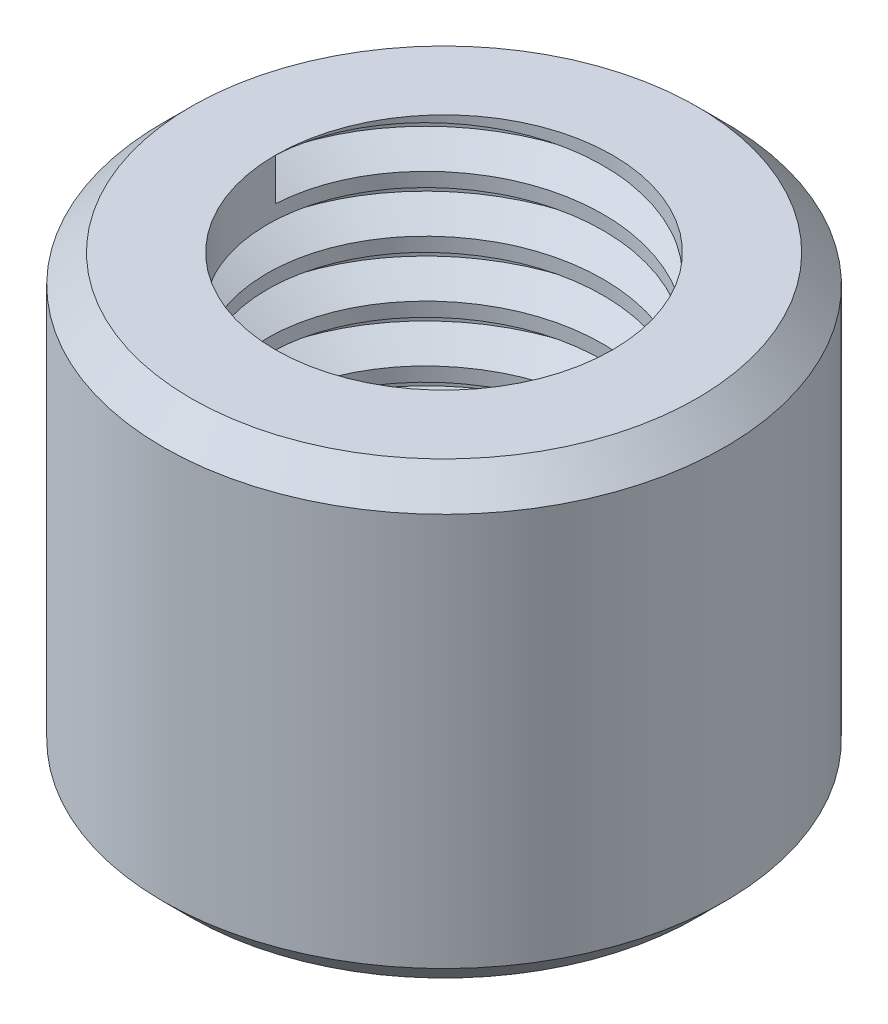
ISO-10303-21;
HEADER;
FILE_DESCRIPTION(('STEP AP214'),'2;1');
FILE_NAME('part.step','',(''),(''),'','','');
FILE_SCHEMA(('AUTOMOTIVE_DESIGN { 1 0 10303 214 1 1 1 1 }'));
ENDSEC;
DATA;
#1=APPLICATION_CONTEXT('core data for automotive mechanical design processes');
#2=APPLICATION_PROTOCOL_DEFINITION('international standard','automotive_design',2000,#1);
#3=PRODUCT_CONTEXT('',#1,'mechanical');
#4=PRODUCT('Part','Part','',(#3));
#5=PRODUCT_RELATED_PRODUCT_CATEGORY('part','',(#4));
#6=PRODUCT_DEFINITION_FORMATION('','',#4);
#7=PRODUCT_DEFINITION_CONTEXT('part definition',#1,'design');
#8=PRODUCT_DEFINITION('design','',#6,#7);
#9=PRODUCT_DEFINITION_SHAPE('','',#8);
#10=(LENGTH_UNIT() NAMED_UNIT(*) SI_UNIT(.MILLI.,.METRE.));
#11=(NAMED_UNIT(*) PLANE_ANGLE_UNIT() SI_UNIT($,.RADIAN.));
#12=(NAMED_UNIT(*) SI_UNIT($,.STERADIAN.) SOLID_ANGLE_UNIT());
#13=UNCERTAINTY_MEASURE_WITH_UNIT(LENGTH_MEASURE(1.E-05),#10,'distance_accuracy_value','');
#14=(GEOMETRIC_REPRESENTATION_CONTEXT(3) GLOBAL_UNCERTAINTY_ASSIGNED_CONTEXT((#13)) GLOBAL_UNIT_ASSIGNED_CONTEXT((#10,
#11,#12)) REPRESENTATION_CONTEXT('',''));
#15=CARTESIAN_POINT('',(0.,0.,0.));
#16=DIRECTION('',(0.,0.,1.));
#17=DIRECTION('',(1.,0.,0.));
#18=AXIS2_PLACEMENT_3D('',#15,#16,#17);
#19=CARTESIAN_POINT('',(0.,0.,0.));
#20=DIRECTION('',(0.,1.,0.));
#21=DIRECTION('',(0.,0.,1.));
#22=AXIS2_PLACEMENT_3D('',#19,#20,#21);
#23=PLANE('',#22);
#24=CARTESIAN_POINT('',(0.,0.,0.));
#25=DIRECTION('',(0.,1.,0.));
#26=DIRECTION('',(0.,0.,1.));
#27=AXIS2_PLACEMENT_3D('',#24,#25,#26);
#28=CIRCLE('',#27,2.25);
#29=CARTESIAN_POINT('',(0.,0.,2.25));
#30=VERTEX_POINT('',#29);
#31=EDGE_CURVE('E242',#30,#30,#28,.F.);
#32=ORIENTED_EDGE('',*,*,#31,.T.);
#33=EDGE_LOOP('',(#32));
#34=FACE_BOUND('',#33,.T.);
#35=CARTESIAN_POINT('',(0.66398733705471,0.,1.64142066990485));
#36=CARTESIAN_POINT('',(0.618060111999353,0.,1.65607975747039));
#37=CARTESIAN_POINT('',(0.571536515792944,0.,1.66879361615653));
#38=CARTESIAN_POINT('',(0.47758576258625,0.,1.6902573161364));
#39=CARTESIAN_POINT('',(0.430158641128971,0.,1.69900731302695));
#40=CARTESIAN_POINT('',(0.287201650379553,0.,1.71916722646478));
#41=CARTESIAN_POINT('',(0.190751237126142,0.,1.72456498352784));
#42=CARTESIAN_POINT('',(-0.00168757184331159,0.,1.71908666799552));
#43=CARTESIAN_POINT('',(-0.0976756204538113,0.,1.70819984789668));
#44=CARTESIAN_POINT('',(-0.286567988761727,0.,1.67041315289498));
#45=CARTESIAN_POINT('',(-0.379470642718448,0.,1.64350477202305));
#46=CARTESIAN_POINT('',(-0.514311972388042,0.,1.59178581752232));
#47=CARTESIAN_POINT('',(-0.558511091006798,0.,1.57265099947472));
#48=CARTESIAN_POINT('',(-0.645146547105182,0.,1.53072711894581));
#49=CARTESIAN_POINT('',(-0.687583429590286,0.,1.50793919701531));
#50=CARTESIAN_POINT('',(-0.749667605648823,0.,1.47114468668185));
#51=CARTESIAN_POINT('',(-0.770101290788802,0.,1.45844382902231));
#52=CARTESIAN_POINT('',(-0.810417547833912,0.,1.43220387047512));
#53=CARTESIAN_POINT('',(-0.830300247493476,0.,1.4186649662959));
#54=CARTESIAN_POINT('',(-0.888975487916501,0.,1.37669791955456));
#55=CARTESIAN_POINT('',(-0.926809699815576,0.,1.34691095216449));
#56=CARTESIAN_POINT('',(-0.998743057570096,0.,1.284720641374));
#57=CARTESIAN_POINT('',(-1.03290819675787,0.,1.25239343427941));
#58=CARTESIAN_POINT('',(-1.09819891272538,0.,1.18481012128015));
#59=CARTESIAN_POINT('',(-1.12932402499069,0.,1.14955356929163));
#60=CARTESIAN_POINT('',(-1.21773557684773,0.,1.03980244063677));
#61=CARTESIAN_POINT('',(-1.27013485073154,0.,0.961260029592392));
#62=CARTESIAN_POINT('',(-1.35720858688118,0.,0.801231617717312));
#63=CARTESIAN_POINT('',(-1.39277646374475,0.,0.720225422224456));
#64=CARTESIAN_POINT('',(-1.44978007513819,0.,0.553388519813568));
#65=CARTESIAN_POINT('',(-1.47122351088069,0.,0.467560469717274));
#66=CARTESIAN_POINT('',(-1.49547638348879,0.,0.317719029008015));
#67=CARTESIAN_POINT('',(-1.5018026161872,0.,0.25425042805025));
#68=CARTESIAN_POINT('',(-1.50670819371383,0.,0.127088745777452));
#69=CARTESIAN_POINT('',(-1.50529654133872,0.,0.0633960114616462));
#70=CARTESIAN_POINT('',(-1.5,0.,0.));
#71=B_SPLINE_CURVE_WITH_KNOTS('',3,(#35,#36,#37,#38,#39,#40,#41,#42,#43,#44,#45,#46,#47,#48,#49,
#50,#51,#52,#53,#54,#55,#56,#57,#58,#59,#60,#61,#62,#63,#64,#65,#66,#67,#68,#69,#70),
.UNSPECIFIED.,.F.,.F.,(4,2,2,2,2,2,2,2,2,2,2,2,2,2,2,2,2,4),(0.,0.144540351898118,
0.289075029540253,0.577383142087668,0.86588161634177,1.15453339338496,1.2988876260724,
1.44319687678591,1.51535750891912,1.58750126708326,1.73173848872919,1.87265093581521,
2.013584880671,2.29515300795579,2.55936658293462,2.82343597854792,3.01433814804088,
3.20501825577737),.UNSPECIFIED.);
#72=CARTESIAN_POINT('',(0.66398733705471,0.,1.64142066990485));
#73=VERTEX_POINT('',#72);
#74=CARTESIAN_POINT('',(-1.5,0.,0.));
#75=VERTEX_POINT('',#74);
#76=EDGE_CURVE('E167',#73,#75,#71,.T.);
#77=ORIENTED_EDGE('',*,*,#76,.F.);
#78=CARTESIAN_POINT('',(1.63205070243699,0.,0.686696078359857));
#79=CARTESIAN_POINT('',(1.61589095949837,0.,0.725122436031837));
#80=CARTESIAN_POINT('',(1.59835591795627,0.,0.762989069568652));
#81=CARTESIAN_POINT('',(1.54135365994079,0.,0.875480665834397));
#82=CARTESIAN_POINT('',(1.49780257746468,0.,0.948075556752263));
#83=CARTESIAN_POINT('',(1.4007324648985,0.,1.08639210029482));
#84=CARTESIAN_POINT('',(1.34719916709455,0.,1.1521037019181));
#85=CARTESIAN_POINT('',(1.2313182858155,0.,1.27520174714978));
#86=CARTESIAN_POINT('',(1.1689725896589,0.,1.3325899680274));
#87=CARTESIAN_POINT('',(1.0367678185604,0.,1.43783838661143));
#88=CARTESIAN_POINT('',(0.966916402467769,0.,1.48570815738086));
#89=CARTESIAN_POINT('',(0.857119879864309,0.,1.54994292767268));
#90=CARTESIAN_POINT('',(0.819405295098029,0.,1.57020628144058));
#91=CARTESIAN_POINT('',(0.742653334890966,0.,1.60792789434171));
#92=CARTESIAN_POINT('',(0.703617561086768,0.,1.62538941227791));
#93=CARTESIAN_POINT('',(0.66398733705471,0.,1.64142066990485));
#94=B_SPLINE_CURVE_WITH_KNOTS('',3,(#78,#79,#80,#81,#82,#83,#84,#85,#86,#87,#88,#89,#90,#91,#92,
#93),.UNSPECIFIED.,.F.,.F.,(4,2,2,2,2,2,2,4),(0.,0.125078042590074,0.378127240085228,
0.631540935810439,0.884900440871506,1.13800382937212,1.26634663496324,1.39453906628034),.UNSPECIFIED.);
#95=CARTESIAN_POINT('',(1.63205070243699,0.,0.686696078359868));
#96=VERTEX_POINT('',#95);
#97=EDGE_CURVE('E11',#96,#73,#94,.T.);
#98=ORIENTED_EDGE('',*,*,#97,.F.);
#99=CARTESIAN_POINT('',(2.4580682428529E-08,0.,-1.5));
#100=CARTESIAN_POINT('',(0.0419012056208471,0.,-1.50402971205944));
#101=CARTESIAN_POINT('',(0.0839452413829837,0.,-1.50628768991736));
#102=CARTESIAN_POINT('',(0.168089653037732,0.,-1.50725042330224));
#103=CARTESIAN_POINT('',(0.21019004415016,0.,-1.5059538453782));
#104=CARTESIAN_POINT('',(0.335767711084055,0.,-1.49674561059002));
#105=CARTESIAN_POINT('',(0.418941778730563,0.,-1.48355544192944));
#106=CARTESIAN_POINT('',(0.54108450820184,0.,-1.45350375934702));
#107=CARTESIAN_POINT('',(0.581402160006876,0.,-1.44175821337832));
#108=CARTESIAN_POINT('',(0.660924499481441,0.,-1.41492313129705));
#109=CARTESIAN_POINT('',(0.700129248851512,0.,-1.39983378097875));
#110=CARTESIAN_POINT('',(0.777148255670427,0.,-1.36640287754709));
#111=CARTESIAN_POINT('',(0.814961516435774,0.,-1.34805904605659));
#112=CARTESIAN_POINT('',(0.889095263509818,0.,-1.30856046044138));
#113=CARTESIAN_POINT('',(0.925415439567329,0.,-1.28740512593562));
#114=CARTESIAN_POINT('',(0.997585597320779,0.,-1.24155397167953));
#115=CARTESIAN_POINT('',(1.03337259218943,0.,-1.21675877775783));
#116=CARTESIAN_POINT('',(1.10285047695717,0.,-1.16441264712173));
#117=CARTESIAN_POINT('',(1.13654203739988,0.,-1.13686259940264));
#118=CARTESIAN_POINT('',(1.20162268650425,0.,-1.07917111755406));
#119=CARTESIAN_POINT('',(1.2330121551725,0.,-1.04903011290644));
#120=CARTESIAN_POINT('',(1.29331835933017,0.,-0.986325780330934));
#121=CARTESIAN_POINT('',(1.32223263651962,0.,-0.953760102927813));
#122=CARTESIAN_POINT('',(1.40814450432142,0.,-0.848842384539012));
#123=CARTESIAN_POINT('',(1.46051457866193,0.,-0.772609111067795));
#124=CARTESIAN_POINT('',(1.55169676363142,0.,-0.612415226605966));
#125=CARTESIAN_POINT('',(1.59050699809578,1.60335772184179E-13,-0.528453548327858));
#126=CARTESIAN_POINT('',(1.63773489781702,0.,-0.398621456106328));
#127=CARTESIAN_POINT('',(1.65164879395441,0.,-0.35468216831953));
#128=CARTESIAN_POINT('',(1.67572167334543,0.,-0.26583006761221));
#129=CARTESIAN_POINT('',(1.68588484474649,0.,-0.220918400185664));
#130=CARTESIAN_POINT('',(1.70242428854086,0.,-0.130323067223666));
#131=CARTESIAN_POINT('',(1.70879432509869,0.,-0.0846382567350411));
#132=CARTESIAN_POINT('',(1.71543475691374,0.,-0.0158352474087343));
#133=CARTESIAN_POINT('',(1.71716253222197,0.,0.00715094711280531));
#134=CARTESIAN_POINT('',(1.71973064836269,0.,0.0531787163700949));
#135=CARTESIAN_POINT('',(1.72057073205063,0.,0.0762203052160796));
#136=CARTESIAN_POINT('',(1.72181255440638,0.,0.149043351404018));
#137=CARTESIAN_POINT('',(1.72057761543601,0.,0.198863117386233));
#138=CARTESIAN_POINT('',(1.71394800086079,0.,0.298217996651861));
#139=CARTESIAN_POINT('',(1.70855333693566,0.,0.347753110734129));
#140=CARTESIAN_POINT('',(1.6936522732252,0.,0.446108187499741));
#141=CARTESIAN_POINT('',(1.6841535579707,0.,0.494929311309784));
#142=CARTESIAN_POINT('',(1.66111536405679,0.,0.5916164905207));
#143=CARTESIAN_POINT('',(1.64757526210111,0.,0.639482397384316));
#144=CARTESIAN_POINT('',(1.63205070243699,0.,0.686696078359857));
#145=B_SPLINE_CURVE_WITH_KNOTS('',3,(#99,#100,#101,#102,#103,#104,#105,#106,#107,#108,#109,#110,
#111,#112,#113,#114,#115,#116,#117,#118,#119,#120,#121,#122,#123,#124,#125,#126,#127,#128,#129,
#130,#131,#132,#133,#134,#135,#136,#137,#138,#139,#140,#141,#142,#143,#144),.UNSPECIFIED.,.F.,
.F.,(4,2,2,2,2,2,2,2,2,2,2,2,2,2,2,2,2,2,2,2,2,2,4),(0.,0.126191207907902,0.252429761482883,
0.503655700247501,0.629525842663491,0.755388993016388,0.881340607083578,1.00731826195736,
1.13778966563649,1.26821910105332,1.39862695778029,1.52916286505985,1.80522284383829,
2.08132100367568,2.21945235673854,2.35742899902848,2.49563185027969,2.56476851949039,
2.63392521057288,2.78323935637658,2.93255308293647,3.0815884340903,3.2306467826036),.UNSPECIFIED.);
#146=CARTESIAN_POINT('',(2.4580682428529E-08,0.,-1.5));
#147=VERTEX_POINT('',#146);
#148=EDGE_CURVE('E157',#147,#96,#145,.T.);
#149=ORIENTED_EDGE('',*,*,#148,.F.);
#150=CARTESIAN_POINT('',(0.,0.,0.));
#151=DIRECTION('',(0.,1.,0.));
#152=DIRECTION('',(0.,0.,1.));
#153=AXIS2_PLACEMENT_3D('',#150,#151,#152);
#154=CIRCLE('',#153,1.5);
#155=EDGE_CURVE('E119',#147,#75,#154,.T.);
#156=ORIENTED_EDGE('',*,*,#155,.T.);
#157=EDGE_LOOP('',(#77,#98,#149,#156));
#158=FACE_BOUND('',#157,.T.);
#159=ADVANCED_FACE('F49',(#34,#158),#23,.F.);
#160=CARTESIAN_POINT('',(0.,4.,0.));
#161=DIRECTION('',(0.,1.,0.));
#162=DIRECTION('',(0.,0.,1.));
#163=AXIS2_PLACEMENT_3D('',#160,#161,#162);
#164=PLANE('',#163);
#165=CARTESIAN_POINT('',(0.,4.,0.));
#166=DIRECTION('',(0.,1.,0.));
#167=DIRECTION('',(0.,0.,1.));
#168=AXIS2_PLACEMENT_3D('',#165,#166,#167);
#169=CIRCLE('',#168,2.25);
#170=CARTESIAN_POINT('',(0.,4.,2.25));
#171=VERTEX_POINT('',#170);
#172=EDGE_CURVE('E65',#171,#171,#169,.T.);
#173=ORIENTED_EDGE('',*,*,#172,.T.);
#174=EDGE_LOOP('',(#173));
#175=FACE_BOUND('',#174,.T.);
#176=CARTESIAN_POINT('',(0.,4.,0.));
#177=DIRECTION('',(0.,1.,0.));
#178=DIRECTION('',(0.,0.,1.));
#179=AXIS2_PLACEMENT_3D('',#176,#177,#178);
#180=CIRCLE('',#179,1.5);
#181=CARTESIAN_POINT('',(-1.5,4.,0.));
#182=VERTEX_POINT('',#181);
#183=EDGE_CURVE('E229',#182,#182,#180,.T.);
#184=ORIENTED_EDGE('',*,*,#183,.F.);
#185=EDGE_LOOP('',(#184));
#186=FACE_BOUND('',#185,.T.);
#187=ADVANCED_FACE('F216',(#175,#186),#164,.T.);
#188=CARTESIAN_POINT('',(0.,4.,0.));
#189=DIRECTION('',(0.,-1.,0.));
#190=DIRECTION('',(0.,0.,-1.));
#191=AXIS2_PLACEMENT_3D('',#188,#189,#190);
#192=CYLINDRICAL_SURFACE('',#191,2.5);
#193=CARTESIAN_POINT('',(0.,0.250000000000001,0.));
#194=DIRECTION('',(0.,1.,0.));
#195=DIRECTION('',(0.,0.,1.));
#196=AXIS2_PLACEMENT_3D('',#193,#194,#195);
#197=CIRCLE('',#196,2.5);
#198=CARTESIAN_POINT('',(0.,0.250000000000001,2.5));
#199=VERTEX_POINT('',#198);
#200=EDGE_CURVE('E235',#199,#199,#197,.T.);
#201=ORIENTED_EDGE('',*,*,#200,.T.);
#202=EDGE_LOOP('',(#201));
#203=FACE_BOUND('',#202,.T.);
#204=CARTESIAN_POINT('',(0.,3.75,0.));
#205=DIRECTION('',(0.,1.,0.));
#206=DIRECTION('',(0.,0.,1.));
#207=AXIS2_PLACEMENT_3D('',#204,#205,#206);
#208=CIRCLE('',#207,2.5);
#209=CARTESIAN_POINT('',(0.,3.75,2.5));
#210=VERTEX_POINT('',#209);
#211=EDGE_CURVE('E231',#210,#210,#208,.F.);
#212=ORIENTED_EDGE('',*,*,#211,.T.);
#213=EDGE_LOOP('',(#212));
#214=FACE_BOUND('',#213,.T.);
#215=ADVANCED_FACE('F215',(#203,#214),#192,.T.);
#216=CARTESIAN_POINT('',(0.,4.,0.));
#217=DIRECTION('',(0.,-1.,0.));
#218=DIRECTION('',(0.,0.,-1.));
#219=AXIS2_PLACEMENT_3D('',#216,#217,#218);
#220=CYLINDRICAL_SURFACE('',#219,1.5);
#221=CARTESIAN_POINT('',(-1.5,3.62500000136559,0.));
#222=CARTESIAN_POINT('',(-1.5,3.58333333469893,-0.866025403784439));
#223=CARTESIAN_POINT('',(-0.75,3.54166666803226,-1.29903810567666));
#224=CARTESIAN_POINT('',(0.,3.50000000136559,-1.73205080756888));
#225=CARTESIAN_POINT('',(0.75,3.45833333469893,-1.29903810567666));
#226=CARTESIAN_POINT('',(1.5,3.41666666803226,-0.866025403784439));
#227=CARTESIAN_POINT('',(1.5,3.37500000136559,0.));
#228=CARTESIAN_POINT('',(1.5,3.33333333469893,0.866025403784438));
#229=CARTESIAN_POINT('',(0.750000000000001,3.29166666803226,1.29903810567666));
#230=CARTESIAN_POINT('',(0.,3.25000000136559,1.73205080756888));
#231=CARTESIAN_POINT('',(-0.749999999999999,3.20833333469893,1.29903810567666));
#232=CARTESIAN_POINT('',(-1.5,3.16666666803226,0.86602540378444));
#233=CARTESIAN_POINT('',(-1.5,3.12500000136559,0.));
#234=CARTESIAN_POINT('',(-1.5,3.08333333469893,-0.866025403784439));
#235=CARTESIAN_POINT('',(-0.75,3.04166666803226,-1.29903810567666));
#236=CARTESIAN_POINT('',(0.,3.00000000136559,-1.73205080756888));
#237=CARTESIAN_POINT('',(0.75,2.95833333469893,-1.29903810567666));
#238=CARTESIAN_POINT('',(1.5,2.91666666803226,-0.866025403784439));
#239=CARTESIAN_POINT('',(1.5,2.87500000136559,0.));
#240=CARTESIAN_POINT('',(1.5,2.83333333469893,0.866025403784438));
#241=CARTESIAN_POINT('',(0.750000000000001,2.79166666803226,1.29903810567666));
#242=CARTESIAN_POINT('',(0.,2.75000000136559,1.73205080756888));
#243=CARTESIAN_POINT('',(-0.749999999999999,2.70833333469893,1.29903810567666));
#244=CARTESIAN_POINT('',(-1.5,2.66666666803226,0.86602540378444));
#245=CARTESIAN_POINT('',(-1.5,2.62500000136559,0.));
#246=CARTESIAN_POINT('',(-1.5,2.58333333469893,-0.866025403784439));
#247=CARTESIAN_POINT('',(-0.75,2.54166666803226,-1.29903810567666));
#248=CARTESIAN_POINT('',(0.,2.50000000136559,-1.73205080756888));
#249=CARTESIAN_POINT('',(0.75,2.45833333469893,-1.29903810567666));
#250=CARTESIAN_POINT('',(1.5,2.41666666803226,-0.866025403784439));
#251=CARTESIAN_POINT('',(1.5,2.37500000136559,0.));
#252=CARTESIAN_POINT('',(1.5,2.33333333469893,0.866025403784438));
#253=CARTESIAN_POINT('',(0.750000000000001,2.29166666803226,1.29903810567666));
#254=CARTESIAN_POINT('',(0.,2.25000000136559,1.73205080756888));
#255=CARTESIAN_POINT('',(-0.749999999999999,2.20833333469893,1.29903810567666));
#256=CARTESIAN_POINT('',(-1.5,2.16666666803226,0.86602540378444));
#257=CARTESIAN_POINT('',(-1.5,2.12500000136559,0.));
#258=CARTESIAN_POINT('',(-1.5,2.08333333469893,-0.866025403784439));
#259=CARTESIAN_POINT('',(-0.75,2.04166666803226,-1.29903810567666));
#260=CARTESIAN_POINT('',(0.,2.00000000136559,-1.73205080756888));
#261=CARTESIAN_POINT('',(0.75,1.95833333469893,-1.29903810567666));
#262=CARTESIAN_POINT('',(1.5,1.91666666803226,-0.866025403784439));
#263=CARTESIAN_POINT('',(1.5,1.87500000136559,0.));
#264=CARTESIAN_POINT('',(1.5,1.83333333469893,0.866025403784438));
#265=CARTESIAN_POINT('',(0.750000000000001,1.79166666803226,1.29903810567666));
#266=CARTESIAN_POINT('',(0.,1.75000000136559,1.73205080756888));
#267=CARTESIAN_POINT('',(-0.749999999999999,1.70833333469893,1.29903810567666));
#268=CARTESIAN_POINT('',(-1.5,1.66666666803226,0.86602540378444));
#269=CARTESIAN_POINT('',(-1.5,1.62500000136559,0.));
#270=CARTESIAN_POINT('',(-1.5,1.58333333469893,-0.866025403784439));
#271=CARTESIAN_POINT('',(-0.75,1.54166666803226,-1.29903810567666));
#272=CARTESIAN_POINT('',(0.,1.50000000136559,-1.73205080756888));
#273=CARTESIAN_POINT('',(0.75,1.45833333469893,-1.29903810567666));
#274=CARTESIAN_POINT('',(1.5,1.41666666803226,-0.866025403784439));
#275=CARTESIAN_POINT('',(1.5,1.37500000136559,0.));
#276=CARTESIAN_POINT('',(1.5,1.33333333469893,0.866025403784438));
#277=CARTESIAN_POINT('',(0.750000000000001,1.29166666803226,1.29903810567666));
#278=CARTESIAN_POINT('',(0.,1.25000000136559,1.73205080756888));
#279=CARTESIAN_POINT('',(-0.749999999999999,1.20833333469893,1.29903810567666));
#280=CARTESIAN_POINT('',(-1.5,1.16666666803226,0.86602540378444));
#281=CARTESIAN_POINT('',(-1.5,1.12500000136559,0.));
#282=CARTESIAN_POINT('',(-1.5,1.08333333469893,-0.866025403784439));
#283=CARTESIAN_POINT('',(-0.75,1.04166666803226,-1.29903810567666));
#284=CARTESIAN_POINT('',(0.,1.00000000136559,-1.73205080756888));
#285=CARTESIAN_POINT('',(0.75,0.958333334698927,-1.29903810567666));
#286=CARTESIAN_POINT('',(1.5,0.91666666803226,-0.866025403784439));
#287=CARTESIAN_POINT('',(1.5,0.875000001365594,0.));
#288=CARTESIAN_POINT('',(1.5,0.833333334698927,0.866025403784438));
#289=CARTESIAN_POINT('',(0.750000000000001,0.79166666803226,1.29903810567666));
#290=CARTESIAN_POINT('',(0.,0.750000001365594,1.73205080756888));
#291=CARTESIAN_POINT('',(-0.749999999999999,0.708333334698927,1.29903810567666));
#292=CARTESIAN_POINT('',(-1.5,0.66666666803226,0.86602540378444));
#293=CARTESIAN_POINT('',(-1.5,0.625000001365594,0.));
#294=CARTESIAN_POINT('',(-1.5,0.583333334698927,-0.866025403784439));
#295=CARTESIAN_POINT('',(-0.75,0.54166666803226,-1.29903810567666));
#296=CARTESIAN_POINT('',(0.,0.500000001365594,-1.73205080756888));
#297=CARTESIAN_POINT('',(0.75,0.458333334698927,-1.29903810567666));
#298=CARTESIAN_POINT('',(1.5,0.41666666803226,-0.866025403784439));
#299=CARTESIAN_POINT('',(1.5,0.375000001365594,0.));
#300=CARTESIAN_POINT('',(1.5,0.333333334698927,0.866025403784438));
#301=CARTESIAN_POINT('',(0.750000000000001,0.29166666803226,1.29903810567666));
#302=CARTESIAN_POINT('',(0.,0.250000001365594,1.73205080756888));
#303=CARTESIAN_POINT('',(-0.749999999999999,0.208333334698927,1.29903810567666));
#304=CARTESIAN_POINT('',(-1.5,0.16666666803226,0.86602540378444));
#305=CARTESIAN_POINT('',(-1.5,0.125000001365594,0.));
#306=CARTESIAN_POINT('',(-1.5,0.0833333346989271,-0.866025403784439));
#307=CARTESIAN_POINT('',(-0.75,0.0416666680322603,-1.29903810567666));
#308=CARTESIAN_POINT('',(0.,1.36559383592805E-09,-1.73205080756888));
#309=CARTESIAN_POINT('',(0.75,-0.041666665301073,-1.29903810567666));
#310=CARTESIAN_POINT('',(1.5,-0.0833333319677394,-0.866025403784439));
#311=CARTESIAN_POINT('',(1.5,-0.124999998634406,0.));
#312=CARTESIAN_POINT('',(1.5,-0.166666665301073,0.866025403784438));
#313=CARTESIAN_POINT('',(0.750000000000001,-0.20833333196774,1.29903810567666));
#314=CARTESIAN_POINT('',(0.,-0.249999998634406,1.73205080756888));
#315=CARTESIAN_POINT('',(-0.749999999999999,-0.291666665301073,1.29903810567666));
#316=CARTESIAN_POINT('',(-1.5,-0.333333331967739,0.86602540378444));
#317=CARTESIAN_POINT('',(-1.5,-0.374999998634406,0.));
#318=CARTESIAN_POINT('',(-1.5,-0.416666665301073,-0.866025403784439));
#319=CARTESIAN_POINT('',(-0.75,-0.458333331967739,-1.29903810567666));
#320=CARTESIAN_POINT('',(0.,-0.499999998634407,-1.73205080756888));
#321=CARTESIAN_POINT('',(0.75,-0.541666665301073,-1.29903810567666));
#322=CARTESIAN_POINT('',(1.5,-0.583333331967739,-0.866025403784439));
#323=CARTESIAN_POINT('',(1.5,-0.624999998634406,0.));
#324=CARTESIAN_POINT('',(1.5,-0.666666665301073,0.866025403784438));
#325=CARTESIAN_POINT('',(0.750000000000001,-0.70833333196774,1.29903810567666));
#326=CARTESIAN_POINT('',(0.,-0.749999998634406,1.73205080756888));
#327=CARTESIAN_POINT('',(-0.749999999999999,-0.791666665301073,1.29903810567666));
#328=CARTESIAN_POINT('',(-1.5,-0.83333333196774,0.86602540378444));
#329=CARTESIAN_POINT('',(-1.5,-0.874999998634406,0.));
#330=(BOUNDED_CURVE() B_SPLINE_CURVE(2,(#221,#222,#223,#224,#225,#226,#227,#228,#229,#230,#231,
#232,#233,#234,#235,#236,#237,#238,#239,#240,#241,#242,#243,#244,#245,#246,#247,#248,#249,#250,
#251,#252,#253,#254,#255,#256,#257,#258,#259,#260,#261,#262,#263,#264,#265,#266,#267,#268,#269,
#270,#271,#272,#273,#274,#275,#276,#277,#278,#279,#280,#281,#282,#283,#284,#285,#286,#287,#288,
#289,#290,#291,#292,#293,#294,#295,#296,#297,#298,#299,#300,#301,#302,#303,#304,#305,#306,#307,
#308,#309,#310,#311,#312,#313,#314,#315,#316,#317,#318,#319,#320,#321,#322,#323,#324,#325,#326,
#327,#328,#329),.UNSPECIFIED.,.F.,.F.) B_SPLINE_CURVE_WITH_KNOTS((3,2,2,2,2,2,2,2,2,2,2,2,2,2,2,
2,2,2,2,2,2,2,2,2,2,2,2,2,2,2,2,2,2,2,2,2,2,2,2,2,2,2,2,2,2,2,2,2,2,2,2,2,2,2,3),(0.,
0.0185185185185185,0.037037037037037,0.0555555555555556,0.0740740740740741,0.0925925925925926,
0.111111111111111,0.12962962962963,0.148148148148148,0.166666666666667,0.185185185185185,
0.203703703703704,0.222222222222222,0.240740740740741,0.259259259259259,0.277777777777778,
0.296296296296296,0.314814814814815,0.333333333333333,0.351851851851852,0.37037037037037,
0.388888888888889,0.407407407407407,0.425925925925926,0.444444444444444,0.462962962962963,
0.481481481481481,0.5,0.518518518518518,0.537037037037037,0.555555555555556,0.574074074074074,
0.592592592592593,0.611111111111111,0.62962962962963,0.648148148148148,0.666666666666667,
0.685185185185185,0.703703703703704,0.722222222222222,0.740740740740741,0.759259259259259,
0.777777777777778,0.796296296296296,0.814814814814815,0.833333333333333,0.851851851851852,
0.87037037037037,0.888888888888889,0.907407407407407,0.925925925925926,0.944444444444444,
0.962962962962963,0.981481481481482,1.),
.UNSPECIFIED.) CURVE() GEOMETRIC_REPRESENTATION_ITEM() RATIONAL_B_SPLINE_CURVE((1.,
0.866025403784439,1.,0.866025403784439,1.,0.866025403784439,1.,0.866025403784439,1.,
0.866025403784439,1.,0.866025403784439,1.,0.866025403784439,1.,0.866025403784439,1.,
0.866025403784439,1.,0.866025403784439,1.,0.866025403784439,1.,0.866025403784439,1.,
0.866025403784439,1.,0.866025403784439,1.,0.866025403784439,1.,0.866025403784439,1.,
0.866025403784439,1.,0.866025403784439,1.,0.866025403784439,1.,0.866025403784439,1.,
0.866025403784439,1.,0.866025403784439,1.,0.866025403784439,1.,0.866025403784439,1.,
0.866025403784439,1.,0.866025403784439,1.,0.866025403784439,1.,0.866025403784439,1.,
0.866025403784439,1.,0.866025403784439,1.,0.866025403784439,1.,0.866025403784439,1.,
0.866025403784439,1.,0.866025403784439,1.,0.866025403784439,1.,0.866025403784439,1.,
0.866025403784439,1.,0.866025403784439,1.,0.866025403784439,1.,0.866025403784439,1.,
0.866025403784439,1.,0.866025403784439,1.,0.866025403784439,1.,0.866025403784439,1.,
0.866025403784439,1.,0.866025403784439,1.,0.866025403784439,1.,0.866025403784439,1.,
0.866025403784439,1.,0.866025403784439,1.,0.866025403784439,1.,0.866025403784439,1.,
0.866025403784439,1.,0.866025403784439,1.)) REPRESENTATION_ITEM(''));
#331=CARTESIAN_POINT('',(-1.5,3.62500000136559,0.));
#332=VERTEX_POINT('',#331);
#333=EDGE_CURVE('E72',#332,#147,#330,.T.);
#334=ORIENTED_EDGE('',*,*,#333,.F.);
#335=DIRECTION('',(0.,1.,0.));
#336=VECTOR('',#335,1.);
#337=CARTESIAN_POINT('',(-1.5,3.8125000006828,0.));
#338=LINE('',#337,#336);
#339=EDGE_CURVE('E107',#332,#182,#338,.T.);
#340=ORIENTED_EDGE('',*,*,#339,.T.);
#341=ORIENTED_EDGE('',*,*,#183,.T.);
#342=CARTESIAN_POINT('',(-1.5,4.,0.));
#343=CARTESIAN_POINT('',(-1.5,3.95833333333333,-0.866025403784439));
#344=CARTESIAN_POINT('',(-0.75,3.91666666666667,-1.29903810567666));
#345=CARTESIAN_POINT('',(0.,3.875,-1.73205080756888));
#346=CARTESIAN_POINT('',(0.75,3.83333333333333,-1.29903810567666));
#347=CARTESIAN_POINT('',(1.5,3.79166666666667,-0.866025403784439));
#348=CARTESIAN_POINT('',(1.5,3.75,0.));
#349=CARTESIAN_POINT('',(1.5,3.70833333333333,0.866025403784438));
#350=CARTESIAN_POINT('',(0.750000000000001,3.66666666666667,1.29903810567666));
#351=CARTESIAN_POINT('',(0.,3.625,1.73205080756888));
#352=CARTESIAN_POINT('',(-0.749999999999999,3.58333333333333,1.29903810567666));
#353=CARTESIAN_POINT('',(-1.5,3.54166666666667,0.86602540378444));
#354=CARTESIAN_POINT('',(-1.5,3.5,0.));
#355=CARTESIAN_POINT('',(-1.5,3.45833333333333,-0.866025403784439));
#356=CARTESIAN_POINT('',(-0.75,3.41666666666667,-1.29903810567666));
#357=CARTESIAN_POINT('',(0.,3.375,-1.73205080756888));
#358=CARTESIAN_POINT('',(0.75,3.33333333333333,-1.29903810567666));
#359=CARTESIAN_POINT('',(1.5,3.29166666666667,-0.866025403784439));
#360=CARTESIAN_POINT('',(1.5,3.25,0.));
#361=CARTESIAN_POINT('',(1.5,3.20833333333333,0.866025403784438));
#362=CARTESIAN_POINT('',(0.750000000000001,3.16666666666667,1.29903810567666));
#363=CARTESIAN_POINT('',(0.,3.125,1.73205080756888));
#364=CARTESIAN_POINT('',(-0.749999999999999,3.08333333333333,1.29903810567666));
#365=CARTESIAN_POINT('',(-1.5,3.04166666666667,0.86602540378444));
#366=CARTESIAN_POINT('',(-1.5,3.,0.));
#367=CARTESIAN_POINT('',(-1.5,2.95833333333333,-0.866025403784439));
#368=CARTESIAN_POINT('',(-0.75,2.91666666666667,-1.29903810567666));
#369=CARTESIAN_POINT('',(0.,2.875,-1.73205080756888));
#370=CARTESIAN_POINT('',(0.75,2.83333333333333,-1.29903810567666));
#371=CARTESIAN_POINT('',(1.5,2.79166666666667,-0.866025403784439));
#372=CARTESIAN_POINT('',(1.5,2.75,0.));
#373=CARTESIAN_POINT('',(1.5,2.70833333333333,0.866025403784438));
#374=CARTESIAN_POINT('',(0.750000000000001,2.66666666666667,1.29903810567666));
#375=CARTESIAN_POINT('',(0.,2.625,1.73205080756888));
#376=CARTESIAN_POINT('',(-0.749999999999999,2.58333333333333,1.29903810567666));
#377=CARTESIAN_POINT('',(-1.5,2.54166666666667,0.86602540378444));
#378=CARTESIAN_POINT('',(-1.5,2.5,0.));
#379=CARTESIAN_POINT('',(-1.5,2.45833333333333,-0.866025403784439));
#380=CARTESIAN_POINT('',(-0.75,2.41666666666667,-1.29903810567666));
#381=CARTESIAN_POINT('',(0.,2.375,-1.73205080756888));
#382=CARTESIAN_POINT('',(0.75,2.33333333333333,-1.29903810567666));
#383=CARTESIAN_POINT('',(1.5,2.29166666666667,-0.866025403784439));
#384=CARTESIAN_POINT('',(1.5,2.25,0.));
#385=CARTESIAN_POINT('',(1.5,2.20833333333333,0.866025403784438));
#386=CARTESIAN_POINT('',(0.750000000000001,2.16666666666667,1.29903810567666));
#387=CARTESIAN_POINT('',(0.,2.125,1.73205080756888));
#388=CARTESIAN_POINT('',(-0.749999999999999,2.08333333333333,1.29903810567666));
#389=CARTESIAN_POINT('',(-1.5,2.04166666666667,0.86602540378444));
#390=CARTESIAN_POINT('',(-1.5,2.,0.));
#391=CARTESIAN_POINT('',(-1.5,1.95833333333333,-0.866025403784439));
#392=CARTESIAN_POINT('',(-0.75,1.91666666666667,-1.29903810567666));
#393=CARTESIAN_POINT('',(0.,1.875,-1.73205080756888));
#394=CARTESIAN_POINT('',(0.75,1.83333333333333,-1.29903810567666));
#395=CARTESIAN_POINT('',(1.5,1.79166666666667,-0.866025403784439));
#396=CARTESIAN_POINT('',(1.5,1.75,0.));
#397=CARTESIAN_POINT('',(1.5,1.70833333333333,0.866025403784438));
#398=CARTESIAN_POINT('',(0.750000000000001,1.66666666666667,1.29903810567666));
#399=CARTESIAN_POINT('',(0.,1.625,1.73205080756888));
#400=CARTESIAN_POINT('',(-0.749999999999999,1.58333333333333,1.29903810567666));
#401=CARTESIAN_POINT('',(-1.5,1.54166666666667,0.86602540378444));
#402=CARTESIAN_POINT('',(-1.5,1.5,0.));
#403=CARTESIAN_POINT('',(-1.5,1.45833333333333,-0.866025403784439));
#404=CARTESIAN_POINT('',(-0.75,1.41666666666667,-1.29903810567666));
#405=CARTESIAN_POINT('',(0.,1.375,-1.73205080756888));
#406=CARTESIAN_POINT('',(0.75,1.33333333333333,-1.29903810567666));
#407=CARTESIAN_POINT('',(1.5,1.29166666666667,-0.866025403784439));
#408=CARTESIAN_POINT('',(1.5,1.25,0.));
#409=CARTESIAN_POINT('',(1.5,1.20833333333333,0.866025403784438));
#410=CARTESIAN_POINT('',(0.750000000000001,1.16666666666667,1.29903810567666));
#411=CARTESIAN_POINT('',(0.,1.125,1.73205080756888));
#412=CARTESIAN_POINT('',(-0.749999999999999,1.08333333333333,1.29903810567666));
#413=CARTESIAN_POINT('',(-1.5,1.04166666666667,0.86602540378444));
#414=CARTESIAN_POINT('',(-1.5,1.,0.));
#415=CARTESIAN_POINT('',(-1.5,0.958333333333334,-0.866025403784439));
#416=CARTESIAN_POINT('',(-0.75,0.916666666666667,-1.29903810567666));
#417=CARTESIAN_POINT('',(0.,0.875,-1.73205080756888));
#418=CARTESIAN_POINT('',(0.75,0.833333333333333,-1.29903810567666));
#419=CARTESIAN_POINT('',(1.5,0.791666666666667,-0.866025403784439));
#420=CARTESIAN_POINT('',(1.5,0.75,0.));
#421=CARTESIAN_POINT('',(1.5,0.708333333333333,0.866025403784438));
#422=CARTESIAN_POINT('',(0.750000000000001,0.666666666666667,1.29903810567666));
#423=CARTESIAN_POINT('',(0.,0.625,1.73205080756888));
#424=CARTESIAN_POINT('',(-0.749999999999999,0.583333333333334,1.29903810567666));
#425=CARTESIAN_POINT('',(-1.5,0.541666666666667,0.86602540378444));
#426=CARTESIAN_POINT('',(-1.5,0.5,0.));
#427=CARTESIAN_POINT('',(-1.5,0.458333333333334,-0.866025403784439));
#428=CARTESIAN_POINT('',(-0.75,0.416666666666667,-1.29903810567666));
#429=CARTESIAN_POINT('',(0.,0.375,-1.73205080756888));
#430=CARTESIAN_POINT('',(0.75,0.333333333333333,-1.29903810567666));
#431=CARTESIAN_POINT('',(1.5,0.291666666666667,-0.866025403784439));
#432=CARTESIAN_POINT('',(1.5,0.25,0.));
#433=CARTESIAN_POINT('',(1.5,0.208333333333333,0.866025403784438));
#434=CARTESIAN_POINT('',(0.750000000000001,0.166666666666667,1.29903810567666));
#435=CARTESIAN_POINT('',(0.,0.125,1.73205080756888));
#436=CARTESIAN_POINT('',(-0.749999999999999,0.0833333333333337,1.29903810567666));
#437=CARTESIAN_POINT('',(-1.5,0.0416666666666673,0.86602540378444));
#438=CARTESIAN_POINT('',(-1.5,0.,0.));
#439=CARTESIAN_POINT('',(-1.5,-0.0416666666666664,-0.866025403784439));
#440=CARTESIAN_POINT('',(-0.75,-0.0833333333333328,-1.29903810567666));
#441=CARTESIAN_POINT('',(0.,-0.125,-1.73205080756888));
#442=CARTESIAN_POINT('',(0.75,-0.166666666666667,-1.29903810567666));
#443=CARTESIAN_POINT('',(1.5,-0.208333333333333,-0.866025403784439));
#444=CARTESIAN_POINT('',(1.5,-0.249999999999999,0.));
#445=CARTESIAN_POINT('',(1.5,-0.291666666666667,0.866025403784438));
#446=CARTESIAN_POINT('',(0.750000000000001,-0.333333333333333,1.29903810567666));
#447=CARTESIAN_POINT('',(0.,-0.374999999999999,1.73205080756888));
#448=CARTESIAN_POINT('',(-0.749999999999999,-0.416666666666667,1.29903810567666));
#449=CARTESIAN_POINT('',(-1.5,-0.458333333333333,0.86602540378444));
#450=CARTESIAN_POINT('',(-1.5,-0.5,0.));
#451=(BOUNDED_CURVE() B_SPLINE_CURVE(2,(#342,#343,#344,#345,#346,#347,#348,#349,#350,#351,#352,
#353,#354,#355,#356,#357,#358,#359,#360,#361,#362,#363,#364,#365,#366,#367,#368,#369,#370,#371,
#372,#373,#374,#375,#376,#377,#378,#379,#380,#381,#382,#383,#384,#385,#386,#387,#388,#389,#390,
#391,#392,#393,#394,#395,#396,#397,#398,#399,#400,#401,#402,#403,#404,#405,#406,#407,#408,#409,
#410,#411,#412,#413,#414,#415,#416,#417,#418,#419,#420,#421,#422,#423,#424,#425,#426,#427,#428,
#429,#430,#431,#432,#433,#434,#435,#436,#437,#438,#439,#440,#441,#442,#443,#444,#445,#446,#447,
#448,#449,#450),.UNSPECIFIED.,.F.,.F.) B_SPLINE_CURVE_WITH_KNOTS((3,2,2,2,2,2,2,2,2,2,2,2,2,2,2,
2,2,2,2,2,2,2,2,2,2,2,2,2,2,2,2,2,2,2,2,2,2,2,2,2,2,2,2,2,2,2,2,2,2,2,2,2,2,2,3),(0.,
0.0185185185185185,0.037037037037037,0.0555555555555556,0.0740740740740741,0.0925925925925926,
0.111111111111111,0.12962962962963,0.148148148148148,0.166666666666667,0.185185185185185,
0.203703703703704,0.222222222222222,0.240740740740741,0.259259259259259,0.277777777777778,
0.296296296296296,0.314814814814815,0.333333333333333,0.351851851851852,0.37037037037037,
0.388888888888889,0.407407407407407,0.425925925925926,0.444444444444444,0.462962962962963,
0.481481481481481,0.5,0.518518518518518,0.537037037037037,0.555555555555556,0.574074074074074,
0.592592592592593,0.611111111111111,0.62962962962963,0.648148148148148,0.666666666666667,
0.685185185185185,0.703703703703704,0.722222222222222,0.740740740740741,0.759259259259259,
0.777777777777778,0.796296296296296,0.814814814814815,0.833333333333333,0.851851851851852,
0.87037037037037,0.888888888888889,0.907407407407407,0.925925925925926,0.944444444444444,
0.962962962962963,0.981481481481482,1.),
.UNSPECIFIED.) CURVE() GEOMETRIC_REPRESENTATION_ITEM() RATIONAL_B_SPLINE_CURVE((1.,
0.866025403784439,1.,0.866025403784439,1.,0.866025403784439,1.,0.866025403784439,1.,
0.866025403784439,1.,0.866025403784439,1.,0.866025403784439,1.,0.866025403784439,1.,
0.866025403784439,1.,0.866025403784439,1.,0.866025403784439,1.,0.866025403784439,1.,
0.866025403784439,1.,0.866025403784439,1.,0.866025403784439,1.,0.866025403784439,1.,
0.866025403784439,1.,0.866025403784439,1.,0.866025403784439,1.,0.866025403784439,1.,
0.866025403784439,1.,0.866025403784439,1.,0.866025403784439,1.,0.866025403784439,1.,
0.866025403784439,1.,0.866025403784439,1.,0.866025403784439,1.,0.866025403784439,1.,
0.866025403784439,1.,0.866025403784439,1.,0.866025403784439,1.,0.866025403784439,1.,
0.866025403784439,1.,0.866025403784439,1.,0.866025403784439,1.,0.866025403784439,1.,
0.866025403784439,1.,0.866025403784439,1.,0.866025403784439,1.,0.866025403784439,1.,
0.866025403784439,1.,0.866025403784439,1.,0.866025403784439,1.,0.866025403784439,1.,
0.866025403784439,1.,0.866025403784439,1.,0.866025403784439,1.,0.866025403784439,1.,
0.866025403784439,1.,0.866025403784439,1.,0.866025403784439,1.,0.866025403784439,1.,
0.866025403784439,1.,0.866025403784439,1.)) REPRESENTATION_ITEM(''));
#452=EDGE_CURVE('E113',#182,#75,#451,.T.);
#453=ORIENTED_EDGE('',*,*,#452,.T.);
#454=ORIENTED_EDGE('',*,*,#155,.F.);
#455=EDGE_LOOP('',(#334,#340,#341,#453,#454));
#456=FACE_BOUND('',#455,.T.);
#457=ADVANCED_FACE('F116',(#456),#220,.F.);
#458=CARTESIAN_POINT('',(0.,0.250000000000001,0.));
#459=DIRECTION('',(0.,1.,0.));
#460=DIRECTION('',(0.,0.,1.));
#461=AXIS2_PLACEMENT_3D('',#458,#459,#460);
#462=CONICAL_SURFACE('',#461,2.5,0.78539816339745);
#463=ORIENTED_EDGE('',*,*,#31,.F.);
#464=EDGE_LOOP('',(#463));
#465=FACE_BOUND('',#464,.T.);
#466=ORIENTED_EDGE('',*,*,#200,.F.);
#467=EDGE_LOOP('',(#466));
#468=FACE_BOUND('',#467,.T.);
#469=ADVANCED_FACE('F214',(#465,#468),#462,.T.);
#470=CARTESIAN_POINT('',(0.,4.,0.));
#471=DIRECTION('',(0.,-1.,0.));
#472=DIRECTION('',(0.,0.,-1.));
#473=AXIS2_PLACEMENT_3D('',#470,#471,#472);
#474=CONICAL_SURFACE('',#473,2.25,0.785398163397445);
#475=ORIENTED_EDGE('',*,*,#211,.F.);
#476=EDGE_LOOP('',(#475));
#477=FACE_BOUND('',#476,.T.);
#478=ORIENTED_EDGE('',*,*,#172,.F.);
#479=EDGE_LOOP('',(#478));
#480=FACE_BOUND('',#479,.T.);
#481=ADVANCED_FACE('F52',(#477,#480),#474,.T.);
#482=CARTESIAN_POINT('',(-1.7706329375,3.8437500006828,0.));
#483=CARTESIAN_POINT('',(-1.7706329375,3.80208333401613,-1.02227540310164));
#484=CARTESIAN_POINT('',(-0.88531646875,3.76041666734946,-1.53341310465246));
#485=CARTESIAN_POINT('',(0.,3.7187500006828,-2.04455080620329));
#486=CARTESIAN_POINT('',(0.88531646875,3.67708333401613,-1.53341310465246));
#487=CARTESIAN_POINT('',(1.7706329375,3.63541666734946,-1.02227540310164));
#488=CARTESIAN_POINT('',(1.7706329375,3.5937500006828,0.));
#489=CARTESIAN_POINT('',(1.7706329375,3.55208333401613,1.02227540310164));
#490=CARTESIAN_POINT('',(0.885316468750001,3.51041666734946,1.53341310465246));
#491=CARTESIAN_POINT('',(0.,3.4687500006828,2.04455080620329));
#492=CARTESIAN_POINT('',(-0.885316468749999,3.42708333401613,1.53341310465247));
#493=CARTESIAN_POINT('',(-1.7706329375,3.38541666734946,1.02227540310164));
#494=CARTESIAN_POINT('',(-1.7706329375,3.3437500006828,0.));
#495=CARTESIAN_POINT('',(-1.7706329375,3.30208333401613,-1.02227540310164));
#496=CARTESIAN_POINT('',(-0.88531646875,3.26041666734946,-1.53341310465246));
#497=CARTESIAN_POINT('',(0.,3.2187500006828,-2.04455080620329));
#498=CARTESIAN_POINT('',(0.88531646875,3.17708333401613,-1.53341310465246));
#499=CARTESIAN_POINT('',(1.7706329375,3.13541666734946,-1.02227540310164));
#500=CARTESIAN_POINT('',(1.7706329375,3.0937500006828,0.));
#501=CARTESIAN_POINT('',(1.7706329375,3.05208333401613,1.02227540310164));
#502=CARTESIAN_POINT('',(0.885316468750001,3.01041666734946,1.53341310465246));
#503=CARTESIAN_POINT('',(0.,2.9687500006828,2.04455080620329));
#504=CARTESIAN_POINT('',(-0.885316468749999,2.92708333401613,1.53341310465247));
#505=CARTESIAN_POINT('',(-1.7706329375,2.88541666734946,1.02227540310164));
#506=CARTESIAN_POINT('',(-1.7706329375,2.8437500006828,0.));
#507=CARTESIAN_POINT('',(-1.7706329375,2.80208333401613,-1.02227540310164));
#508=CARTESIAN_POINT('',(-0.88531646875,2.76041666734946,-1.53341310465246));
#509=CARTESIAN_POINT('',(0.,2.7187500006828,-2.04455080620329));
#510=CARTESIAN_POINT('',(0.88531646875,2.67708333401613,-1.53341310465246));
#511=CARTESIAN_POINT('',(1.7706329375,2.63541666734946,-1.02227540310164));
#512=CARTESIAN_POINT('',(1.7706329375,2.5937500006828,0.));
#513=CARTESIAN_POINT('',(1.7706329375,2.55208333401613,1.02227540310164));
#514=CARTESIAN_POINT('',(0.885316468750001,2.51041666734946,1.53341310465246));
#515=CARTESIAN_POINT('',(0.,2.4687500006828,2.04455080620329));
#516=CARTESIAN_POINT('',(-0.885316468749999,2.42708333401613,1.53341310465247));
#517=CARTESIAN_POINT('',(-1.7706329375,2.38541666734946,1.02227540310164));
#518=CARTESIAN_POINT('',(-1.7706329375,2.3437500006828,0.));
#519=CARTESIAN_POINT('',(-1.7706329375,2.30208333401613,-1.02227540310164));
#520=CARTESIAN_POINT('',(-0.88531646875,2.26041666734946,-1.53341310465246));
#521=CARTESIAN_POINT('',(0.,2.2187500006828,-2.04455080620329));
#522=CARTESIAN_POINT('',(0.88531646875,2.17708333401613,-1.53341310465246));
#523=CARTESIAN_POINT('',(1.7706329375,2.13541666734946,-1.02227540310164));
#524=CARTESIAN_POINT('',(1.7706329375,2.0937500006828,0.));
#525=CARTESIAN_POINT('',(1.7706329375,2.05208333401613,1.02227540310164));
#526=CARTESIAN_POINT('',(0.885316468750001,2.01041666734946,1.53341310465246));
#527=CARTESIAN_POINT('',(0.,1.9687500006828,2.04455080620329));
#528=CARTESIAN_POINT('',(-0.885316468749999,1.92708333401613,1.53341310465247));
#529=CARTESIAN_POINT('',(-1.7706329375,1.88541666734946,1.02227540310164));
#530=CARTESIAN_POINT('',(-1.7706329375,1.8437500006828,0.));
#531=CARTESIAN_POINT('',(-1.7706329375,1.80208333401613,-1.02227540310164));
#532=CARTESIAN_POINT('',(-0.88531646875,1.76041666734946,-1.53341310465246));
#533=CARTESIAN_POINT('',(0.,1.7187500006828,-2.04455080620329));
#534=CARTESIAN_POINT('',(0.88531646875,1.67708333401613,-1.53341310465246));
#535=CARTESIAN_POINT('',(1.7706329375,1.63541666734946,-1.02227540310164));
#536=CARTESIAN_POINT('',(1.7706329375,1.5937500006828,0.));
#537=CARTESIAN_POINT('',(1.7706329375,1.55208333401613,1.02227540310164));
#538=CARTESIAN_POINT('',(0.885316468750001,1.51041666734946,1.53341310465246));
#539=CARTESIAN_POINT('',(0.,1.4687500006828,2.04455080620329));
#540=CARTESIAN_POINT('',(-0.885316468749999,1.42708333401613,1.53341310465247));
#541=CARTESIAN_POINT('',(-1.7706329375,1.38541666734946,1.02227540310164));
#542=CARTESIAN_POINT('',(-1.7706329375,1.3437500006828,0.));
#543=CARTESIAN_POINT('',(-1.7706329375,1.30208333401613,-1.02227540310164));
#544=CARTESIAN_POINT('',(-0.88531646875,1.26041666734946,-1.53341310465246));
#545=CARTESIAN_POINT('',(0.,1.2187500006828,-2.04455080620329));
#546=CARTESIAN_POINT('',(0.88531646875,1.17708333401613,-1.53341310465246));
#547=CARTESIAN_POINT('',(1.7706329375,1.13541666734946,-1.02227540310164));
#548=CARTESIAN_POINT('',(1.7706329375,1.0937500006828,0.));
#549=CARTESIAN_POINT('',(1.7706329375,1.05208333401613,1.02227540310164));
#550=CARTESIAN_POINT('',(0.885316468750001,1.01041666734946,1.53341310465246));
#551=CARTESIAN_POINT('',(0.,0.968750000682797,2.04455080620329));
#552=CARTESIAN_POINT('',(-0.885316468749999,0.92708333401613,1.53341310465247));
#553=CARTESIAN_POINT('',(-1.7706329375,0.885416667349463,1.02227540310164));
#554=CARTESIAN_POINT('',(-1.7706329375,0.843750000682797,0.));
#555=CARTESIAN_POINT('',(-1.7706329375,0.80208333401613,-1.02227540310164));
#556=CARTESIAN_POINT('',(-0.88531646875,0.760416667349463,-1.53341310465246));
#557=CARTESIAN_POINT('',(0.,0.718750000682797,-2.04455080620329));
#558=CARTESIAN_POINT('',(0.88531646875,0.67708333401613,-1.53341310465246));
#559=CARTESIAN_POINT('',(1.7706329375,0.635416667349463,-1.02227540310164));
#560=CARTESIAN_POINT('',(1.7706329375,0.593750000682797,0.));
#561=CARTESIAN_POINT('',(1.7706329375,0.55208333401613,1.02227540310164));
#562=CARTESIAN_POINT('',(0.885316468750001,0.510416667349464,1.53341310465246));
#563=CARTESIAN_POINT('',(0.,0.468750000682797,2.04455080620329));
#564=CARTESIAN_POINT('',(-0.885316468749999,0.42708333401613,1.53341310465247));
#565=CARTESIAN_POINT('',(-1.7706329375,0.385416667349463,1.02227540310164));
#566=CARTESIAN_POINT('',(-1.7706329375,0.343750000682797,0.));
#567=CARTESIAN_POINT('',(-1.7706329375,0.30208333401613,-1.02227540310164));
#568=CARTESIAN_POINT('',(-0.88531646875,0.260416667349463,-1.53341310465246));
#569=CARTESIAN_POINT('',(0.,0.218750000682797,-2.04455080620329));
#570=CARTESIAN_POINT('',(0.88531646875,0.17708333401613,-1.53341310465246));
#571=CARTESIAN_POINT('',(1.7706329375,0.135416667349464,-1.02227540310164));
#572=CARTESIAN_POINT('',(1.7706329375,0.0937500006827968,0.));
#573=CARTESIAN_POINT('',(1.7706329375,0.0520833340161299,1.02227540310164));
#574=CARTESIAN_POINT('',(0.885316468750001,0.0104166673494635,1.53341310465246));
#575=CARTESIAN_POINT('',(0.,-0.0312499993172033,2.04455080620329));
#576=CARTESIAN_POINT('',(-0.885316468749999,-0.0729166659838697,1.53341310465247));
#577=CARTESIAN_POINT('',(-1.7706329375,-0.114583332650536,1.02227540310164));
#578=CARTESIAN_POINT('',(-1.7706329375,-0.156249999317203,0.));
#579=CARTESIAN_POINT('',(-1.7706329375,-0.19791666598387,-1.02227540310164));
#580=CARTESIAN_POINT('',(-0.88531646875,-0.239583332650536,-1.53341310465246));
#581=CARTESIAN_POINT('',(0.,-0.281249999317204,-2.04455080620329));
#582=CARTESIAN_POINT('',(0.88531646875,-0.32291666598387,-1.53341310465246));
#583=CARTESIAN_POINT('',(1.7706329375,-0.364583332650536,-1.02227540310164));
#584=CARTESIAN_POINT('',(1.7706329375,-0.406249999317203,0.));
#585=CARTESIAN_POINT('',(1.7706329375,-0.44791666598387,1.02227540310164));
#586=CARTESIAN_POINT('',(0.885316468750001,-0.489583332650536,1.53341310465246));
#587=CARTESIAN_POINT('',(0.,-0.531249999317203,2.04455080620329));
#588=CARTESIAN_POINT('',(-0.885316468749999,-0.57291666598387,1.53341310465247));
#589=CARTESIAN_POINT('',(-1.7706329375,-0.614583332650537,1.02227540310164));
#590=CARTESIAN_POINT('',(-1.7706329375,-0.656249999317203,0.));
#591=CARTESIAN_POINT('',(-1.7706329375,3.7812500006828,0.));
#592=CARTESIAN_POINT('',(-1.7706329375,3.73958333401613,-1.02227540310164));
#593=CARTESIAN_POINT('',(-0.88531646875,3.69791666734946,-1.53341310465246));
#594=CARTESIAN_POINT('',(0.,3.6562500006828,-2.04455080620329));
#595=CARTESIAN_POINT('',(0.88531646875,3.61458333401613,-1.53341310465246));
#596=CARTESIAN_POINT('',(1.7706329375,3.57291666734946,-1.02227540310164));
#597=CARTESIAN_POINT('',(1.7706329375,3.5312500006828,0.));
#598=CARTESIAN_POINT('',(1.7706329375,3.48958333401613,1.02227540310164));
#599=CARTESIAN_POINT('',(0.885316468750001,3.44791666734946,1.53341310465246));
#600=CARTESIAN_POINT('',(0.,3.4062500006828,2.04455080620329));
#601=CARTESIAN_POINT('',(-0.885316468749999,3.36458333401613,1.53341310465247));
#602=CARTESIAN_POINT('',(-1.7706329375,3.32291666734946,1.02227540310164));
#603=CARTESIAN_POINT('',(-1.7706329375,3.2812500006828,0.));
#604=CARTESIAN_POINT('',(-1.7706329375,3.23958333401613,-1.02227540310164));
#605=CARTESIAN_POINT('',(-0.88531646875,3.19791666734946,-1.53341310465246));
#606=CARTESIAN_POINT('',(0.,3.1562500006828,-2.04455080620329));
#607=CARTESIAN_POINT('',(0.88531646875,3.11458333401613,-1.53341310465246));
#608=CARTESIAN_POINT('',(1.7706329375,3.07291666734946,-1.02227540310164));
#609=CARTESIAN_POINT('',(1.7706329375,3.0312500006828,0.));
#610=CARTESIAN_POINT('',(1.7706329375,2.98958333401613,1.02227540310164));
#611=CARTESIAN_POINT('',(0.885316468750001,2.94791666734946,1.53341310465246));
#612=CARTESIAN_POINT('',(0.,2.9062500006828,2.04455080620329));
#613=CARTESIAN_POINT('',(-0.885316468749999,2.86458333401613,1.53341310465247));
#614=CARTESIAN_POINT('',(-1.7706329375,2.82291666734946,1.02227540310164));
#615=CARTESIAN_POINT('',(-1.7706329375,2.7812500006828,0.));
#616=CARTESIAN_POINT('',(-1.7706329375,2.73958333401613,-1.02227540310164));
#617=CARTESIAN_POINT('',(-0.88531646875,2.69791666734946,-1.53341310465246));
#618=CARTESIAN_POINT('',(0.,2.6562500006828,-2.04455080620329));
#619=CARTESIAN_POINT('',(0.88531646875,2.61458333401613,-1.53341310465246));
#620=CARTESIAN_POINT('',(1.7706329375,2.57291666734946,-1.02227540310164));
#621=CARTESIAN_POINT('',(1.7706329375,2.5312500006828,0.));
#622=CARTESIAN_POINT('',(1.7706329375,2.48958333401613,1.02227540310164));
#623=CARTESIAN_POINT('',(0.885316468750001,2.44791666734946,1.53341310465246));
#624=CARTESIAN_POINT('',(0.,2.4062500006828,2.04455080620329));
#625=CARTESIAN_POINT('',(-0.885316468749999,2.36458333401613,1.53341310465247));
#626=CARTESIAN_POINT('',(-1.7706329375,2.32291666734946,1.02227540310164));
#627=CARTESIAN_POINT('',(-1.7706329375,2.2812500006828,0.));
#628=CARTESIAN_POINT('',(-1.7706329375,2.23958333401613,-1.02227540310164));
#629=CARTESIAN_POINT('',(-0.88531646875,2.19791666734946,-1.53341310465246));
#630=CARTESIAN_POINT('',(0.,2.1562500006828,-2.04455080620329));
#631=CARTESIAN_POINT('',(0.88531646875,2.11458333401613,-1.53341310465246));
#632=CARTESIAN_POINT('',(1.7706329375,2.07291666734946,-1.02227540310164));
#633=CARTESIAN_POINT('',(1.7706329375,2.0312500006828,0.));
#634=CARTESIAN_POINT('',(1.7706329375,1.98958333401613,1.02227540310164));
#635=CARTESIAN_POINT('',(0.885316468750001,1.94791666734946,1.53341310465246));
#636=CARTESIAN_POINT('',(0.,1.9062500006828,2.04455080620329));
#637=CARTESIAN_POINT('',(-0.885316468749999,1.86458333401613,1.53341310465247));
#638=CARTESIAN_POINT('',(-1.7706329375,1.82291666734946,1.02227540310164));
#639=CARTESIAN_POINT('',(-1.7706329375,1.7812500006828,0.));
#640=CARTESIAN_POINT('',(-1.7706329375,1.73958333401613,-1.02227540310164));
#641=CARTESIAN_POINT('',(-0.88531646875,1.69791666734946,-1.53341310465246));
#642=CARTESIAN_POINT('',(0.,1.6562500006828,-2.04455080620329));
#643=CARTESIAN_POINT('',(0.88531646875,1.61458333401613,-1.53341310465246));
#644=CARTESIAN_POINT('',(1.7706329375,1.57291666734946,-1.02227540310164));
#645=CARTESIAN_POINT('',(1.7706329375,1.5312500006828,0.));
#646=CARTESIAN_POINT('',(1.7706329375,1.48958333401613,1.02227540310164));
#647=CARTESIAN_POINT('',(0.885316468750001,1.44791666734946,1.53341310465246));
#648=CARTESIAN_POINT('',(0.,1.4062500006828,2.04455080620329));
#649=CARTESIAN_POINT('',(-0.885316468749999,1.36458333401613,1.53341310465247));
#650=CARTESIAN_POINT('',(-1.7706329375,1.32291666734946,1.02227540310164));
#651=CARTESIAN_POINT('',(-1.7706329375,1.2812500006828,0.));
#652=CARTESIAN_POINT('',(-1.7706329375,1.23958333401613,-1.02227540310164));
#653=CARTESIAN_POINT('',(-0.88531646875,1.19791666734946,-1.53341310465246));
#654=CARTESIAN_POINT('',(0.,1.1562500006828,-2.04455080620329));
#655=CARTESIAN_POINT('',(0.88531646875,1.11458333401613,-1.53341310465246));
#656=CARTESIAN_POINT('',(1.7706329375,1.07291666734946,-1.02227540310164));
#657=CARTESIAN_POINT('',(1.7706329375,1.0312500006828,0.));
#658=CARTESIAN_POINT('',(1.7706329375,0.98958333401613,1.02227540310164));
#659=CARTESIAN_POINT('',(0.885316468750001,0.947916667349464,1.53341310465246));
#660=CARTESIAN_POINT('',(0.,0.906250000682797,2.04455080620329));
#661=CARTESIAN_POINT('',(-0.885316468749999,0.864583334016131,1.53341310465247));
#662=CARTESIAN_POINT('',(-1.7706329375,0.822916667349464,1.02227540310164));
#663=CARTESIAN_POINT('',(-1.7706329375,0.781250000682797,0.));
#664=CARTESIAN_POINT('',(-1.7706329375,0.739583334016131,-1.02227540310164));
#665=CARTESIAN_POINT('',(-0.88531646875,0.697916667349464,-1.53341310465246));
#666=CARTESIAN_POINT('',(0.,0.656250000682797,-2.04455080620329));
#667=CARTESIAN_POINT('',(0.88531646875,0.61458333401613,-1.53341310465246));
#668=CARTESIAN_POINT('',(1.7706329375,0.572916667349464,-1.02227540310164));
#669=CARTESIAN_POINT('',(1.7706329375,0.531250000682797,0.));
#670=CARTESIAN_POINT('',(1.7706329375,0.48958333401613,1.02227540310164));
#671=CARTESIAN_POINT('',(0.885316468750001,0.447916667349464,1.53341310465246));
#672=CARTESIAN_POINT('',(0.,0.406250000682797,2.04455080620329));
#673=CARTESIAN_POINT('',(-0.885316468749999,0.364583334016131,1.53341310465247));
#674=CARTESIAN_POINT('',(-1.7706329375,0.322916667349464,1.02227540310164));
#675=CARTESIAN_POINT('',(-1.7706329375,0.281250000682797,0.));
#676=CARTESIAN_POINT('',(-1.7706329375,0.239583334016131,-1.02227540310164));
#677=CARTESIAN_POINT('',(-0.88531646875,0.197916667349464,-1.53341310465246));
#678=CARTESIAN_POINT('',(0.,0.156250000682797,-2.04455080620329));
#679=CARTESIAN_POINT('',(0.88531646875,0.11458333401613,-1.53341310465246));
#680=CARTESIAN_POINT('',(1.7706329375,0.072916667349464,-1.02227540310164));
#681=CARTESIAN_POINT('',(1.7706329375,0.0312500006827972,0.));
#682=CARTESIAN_POINT('',(1.7706329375,-0.0104166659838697,1.02227540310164));
#683=CARTESIAN_POINT('',(0.885316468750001,-0.0520833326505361,1.53341310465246));
#684=CARTESIAN_POINT('',(0.,-0.0937499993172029,2.04455080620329));
#685=CARTESIAN_POINT('',(-0.885316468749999,-0.135416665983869,1.53341310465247));
#686=CARTESIAN_POINT('',(-1.7706329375,-0.177083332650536,1.02227540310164));
#687=CARTESIAN_POINT('',(-1.7706329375,-0.218749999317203,0.));
#688=CARTESIAN_POINT('',(-1.7706329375,-0.260416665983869,-1.02227540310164));
#689=CARTESIAN_POINT('',(-0.88531646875,-0.302083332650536,-1.53341310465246));
#690=CARTESIAN_POINT('',(0.,-0.343749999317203,-2.04455080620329));
#691=CARTESIAN_POINT('',(0.88531646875,-0.38541666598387,-1.53341310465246));
#692=CARTESIAN_POINT('',(1.7706329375,-0.427083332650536,-1.02227540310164));
#693=CARTESIAN_POINT('',(1.7706329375,-0.468749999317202,0.));
#694=CARTESIAN_POINT('',(1.7706329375,-0.51041666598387,1.02227540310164));
#695=CARTESIAN_POINT('',(0.885316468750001,-0.552083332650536,1.53341310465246));
#696=CARTESIAN_POINT('',(0.,-0.593749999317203,2.04455080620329));
#697=CARTESIAN_POINT('',(-0.885316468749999,-0.63541666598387,1.53341310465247));
#698=CARTESIAN_POINT('',(-1.7706329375,-0.677083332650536,1.02227540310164));
#699=CARTESIAN_POINT('',(-1.7706329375,-0.718749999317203,0.));
#700=(BOUNDED_SURFACE() B_SPLINE_SURFACE(1,2,((#482,#483,#484,#485,#486,#487,#488,#489,#490,
#491,#492,#493,#494,#495,#496,#497,#498,#499,#500,#501,#502,#503,#504,#505,#506,#507,#508,#509,
#510,#511,#512,#513,#514,#515,#516,#517,#518,#519,#520,#521,#522,#523,#524,#525,#526,#527,#528,
#529,#530,#531,#532,#533,#534,#535,#536,#537,#538,#539,#540,#541,#542,#543,#544,#545,#546,#547,
#548,#549,#550,#551,#552,#553,#554,#555,#556,#557,#558,#559,#560,#561,#562,#563,#564,#565,#566,
#567,#568,#569,#570,#571,#572,#573,#574,#575,#576,#577,#578,#579,#580,#581,#582,#583,#584,#585,
#586,#587,#588,#589,#590),(#591,#592,#593,#594,#595,#596,#597,#598,#599,#600,#601,#602,#603,
#604,#605,#606,#607,#608,#609,#610,#611,#612,#613,#614,#615,#616,#617,#618,#619,#620,#621,#622,
#623,#624,#625,#626,#627,#628,#629,#630,#631,#632,#633,#634,#635,#636,#637,#638,#639,#640,#641,
#642,#643,#644,#645,#646,#647,#648,#649,#650,#651,#652,#653,#654,#655,#656,#657,#658,#659,#660,
#661,#662,#663,#664,#665,#666,#667,#668,#669,#670,#671,#672,#673,#674,#675,#676,#677,#678,#679,
#680,#681,#682,#683,#684,#685,#686,#687,#688,#689,#690,#691,#692,#693,#694,#695,#696,#697,#698,
#699)),.UNSPECIFIED.,.F.,.F.,.F.) B_SPLINE_SURFACE_WITH_KNOTS((2,2),(3,2,2,2,2,2,2,2,2,2,2,2,2,
2,2,2,2,2,2,2,2,2,2,2,2,2,2,2,2,2,2,2,2,2,2,2,2,2,2,2,2,2,2,2,2,2,2,2,2,2,2,2,2,2,3),(0.,1.),
(0.,0.0185185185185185,0.037037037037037,0.0555555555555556,0.0740740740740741,
0.0925925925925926,0.111111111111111,0.12962962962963,0.148148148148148,0.166666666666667,
0.185185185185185,0.203703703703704,0.222222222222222,0.240740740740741,0.259259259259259,
0.277777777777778,0.296296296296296,0.314814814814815,0.333333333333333,0.351851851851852,
0.37037037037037,0.388888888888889,0.407407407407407,0.425925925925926,0.444444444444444,
0.462962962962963,0.481481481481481,0.5,0.518518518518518,0.537037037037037,0.555555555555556,
0.574074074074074,0.592592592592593,0.611111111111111,0.62962962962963,0.648148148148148,
0.666666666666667,0.685185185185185,0.703703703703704,0.722222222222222,0.740740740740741,
0.759259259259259,0.777777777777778,0.796296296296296,0.814814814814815,0.833333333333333,
0.851851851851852,0.87037037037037,0.888888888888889,0.907407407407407,0.925925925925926,
0.944444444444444,0.962962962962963,0.981481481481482,1.),
.UNSPECIFIED.) GEOMETRIC_REPRESENTATION_ITEM() RATIONAL_B_SPLINE_SURFACE(((1.,0.866025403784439,
1.,0.866025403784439,1.,0.866025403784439,1.,0.866025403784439,1.,0.866025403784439,1.,
0.866025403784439,1.,0.866025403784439,1.,0.866025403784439,1.,0.866025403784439,1.,
0.866025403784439,1.,0.866025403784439,1.,0.866025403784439,1.,0.866025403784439,1.,
0.866025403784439,1.,0.866025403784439,1.,0.866025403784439,1.,0.866025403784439,1.,
0.866025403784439,1.,0.866025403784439,1.,0.866025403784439,1.,0.866025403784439,1.,
0.866025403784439,1.,0.866025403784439,1.,0.866025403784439,1.,0.866025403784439,1.,
0.866025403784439,1.,0.866025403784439,1.,0.866025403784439,1.,0.866025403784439,1.,
0.866025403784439,1.,0.866025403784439,1.,0.866025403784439,1.,0.866025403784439,1.,
0.866025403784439,1.,0.866025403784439,1.,0.866025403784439,1.,0.866025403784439,1.,
0.866025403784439,1.,0.866025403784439,1.,0.866025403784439,1.,0.866025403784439,1.,
0.866025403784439,1.,0.866025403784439,1.,0.866025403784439,1.,0.866025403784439,1.,
0.866025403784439,1.,0.866025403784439,1.,0.866025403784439,1.,0.866025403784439,1.,
0.866025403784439,1.,0.866025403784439,1.,0.866025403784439,1.,0.866025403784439,1.,
0.866025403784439,1.),(1.,0.866025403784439,1.,0.866025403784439,1.,0.866025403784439,1.,
0.866025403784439,1.,0.866025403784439,1.,0.866025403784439,1.,0.866025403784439,1.,
0.866025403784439,1.,0.866025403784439,1.,0.866025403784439,1.,0.866025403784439,1.,
0.866025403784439,1.,0.866025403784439,1.,0.866025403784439,1.,0.866025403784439,1.,
0.866025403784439,1.,0.866025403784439,1.,0.866025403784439,1.,0.866025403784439,1.,
0.866025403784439,1.,0.866025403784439,1.,0.866025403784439,1.,0.866025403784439,1.,
0.866025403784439,1.,0.866025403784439,1.,0.866025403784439,1.,0.866025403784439,1.,
0.866025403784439,1.,0.866025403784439,1.,0.866025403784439,1.,0.866025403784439,1.,
0.866025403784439,1.,0.866025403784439,1.,0.866025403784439,1.,0.866025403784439,1.,
0.866025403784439,1.,0.866025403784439,1.,0.866025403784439,1.,0.866025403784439,1.,
0.866025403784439,1.,0.866025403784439,1.,0.866025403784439,1.,0.866025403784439,1.,
0.866025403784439,1.,0.866025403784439,1.,0.866025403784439,1.,0.866025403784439,1.,
0.866025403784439,1.,0.866025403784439,1.,0.866025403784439,1.,0.866025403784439,1.,
0.866025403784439,1.,0.866025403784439,1.,0.866025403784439,1.))) REPRESENTATION_ITEM('') SURFACE());
#701=CARTESIAN_POINT('',(-1.7706329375,3.8437500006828,0.));
#702=CARTESIAN_POINT('',(-1.7706329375,3.80208333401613,-1.02227540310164));
#703=CARTESIAN_POINT('',(-0.88531646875,3.76041666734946,-1.53341310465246));
#704=CARTESIAN_POINT('',(0.,3.7187500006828,-2.04455080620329));
#705=CARTESIAN_POINT('',(0.88531646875,3.67708333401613,-1.53341310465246));
#706=CARTESIAN_POINT('',(1.7706329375,3.63541666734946,-1.02227540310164));
#707=CARTESIAN_POINT('',(1.7706329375,3.5937500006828,0.));
#708=CARTESIAN_POINT('',(1.7706329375,3.55208333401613,1.02227540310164));
#709=CARTESIAN_POINT('',(0.885316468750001,3.51041666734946,1.53341310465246));
#710=CARTESIAN_POINT('',(0.,3.4687500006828,2.04455080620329));
#711=CARTESIAN_POINT('',(-0.885316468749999,3.42708333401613,1.53341310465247));
#712=CARTESIAN_POINT('',(-1.7706329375,3.38541666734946,1.02227540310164));
#713=CARTESIAN_POINT('',(-1.7706329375,3.3437500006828,0.));
#714=CARTESIAN_POINT('',(-1.7706329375,3.30208333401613,-1.02227540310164));
#715=CARTESIAN_POINT('',(-0.88531646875,3.26041666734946,-1.53341310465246));
#716=CARTESIAN_POINT('',(0.,3.2187500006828,-2.04455080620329));
#717=CARTESIAN_POINT('',(0.88531646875,3.17708333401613,-1.53341310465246));
#718=CARTESIAN_POINT('',(1.7706329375,3.13541666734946,-1.02227540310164));
#719=CARTESIAN_POINT('',(1.7706329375,3.0937500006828,0.));
#720=CARTESIAN_POINT('',(1.7706329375,3.05208333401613,1.02227540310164));
#721=CARTESIAN_POINT('',(0.885316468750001,3.01041666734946,1.53341310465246));
#722=CARTESIAN_POINT('',(0.,2.9687500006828,2.04455080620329));
#723=CARTESIAN_POINT('',(-0.885316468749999,2.92708333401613,1.53341310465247));
#724=CARTESIAN_POINT('',(-1.7706329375,2.88541666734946,1.02227540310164));
#725=CARTESIAN_POINT('',(-1.7706329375,2.8437500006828,0.));
#726=CARTESIAN_POINT('',(-1.7706329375,2.80208333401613,-1.02227540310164));
#727=CARTESIAN_POINT('',(-0.88531646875,2.76041666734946,-1.53341310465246));
#728=CARTESIAN_POINT('',(0.,2.7187500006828,-2.04455080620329));
#729=CARTESIAN_POINT('',(0.88531646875,2.67708333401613,-1.53341310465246));
#730=CARTESIAN_POINT('',(1.7706329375,2.63541666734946,-1.02227540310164));
#731=CARTESIAN_POINT('',(1.7706329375,2.5937500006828,0.));
#732=CARTESIAN_POINT('',(1.7706329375,2.55208333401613,1.02227540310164));
#733=CARTESIAN_POINT('',(0.885316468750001,2.51041666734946,1.53341310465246));
#734=CARTESIAN_POINT('',(0.,2.4687500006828,2.04455080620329));
#735=CARTESIAN_POINT('',(-0.885316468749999,2.42708333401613,1.53341310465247));
#736=CARTESIAN_POINT('',(-1.7706329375,2.38541666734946,1.02227540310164));
#737=CARTESIAN_POINT('',(-1.7706329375,2.3437500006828,0.));
#738=CARTESIAN_POINT('',(-1.7706329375,2.30208333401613,-1.02227540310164));
#739=CARTESIAN_POINT('',(-0.88531646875,2.26041666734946,-1.53341310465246));
#740=CARTESIAN_POINT('',(0.,2.2187500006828,-2.04455080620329));
#741=CARTESIAN_POINT('',(0.88531646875,2.17708333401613,-1.53341310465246));
#742=CARTESIAN_POINT('',(1.7706329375,2.13541666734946,-1.02227540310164));
#743=CARTESIAN_POINT('',(1.7706329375,2.0937500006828,0.));
#744=CARTESIAN_POINT('',(1.7706329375,2.05208333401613,1.02227540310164));
#745=CARTESIAN_POINT('',(0.885316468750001,2.01041666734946,1.53341310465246));
#746=CARTESIAN_POINT('',(0.,1.9687500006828,2.04455080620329));
#747=CARTESIAN_POINT('',(-0.885316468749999,1.92708333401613,1.53341310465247));
#748=CARTESIAN_POINT('',(-1.7706329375,1.88541666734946,1.02227540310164));
#749=CARTESIAN_POINT('',(-1.7706329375,1.8437500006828,0.));
#750=CARTESIAN_POINT('',(-1.7706329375,1.80208333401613,-1.02227540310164));
#751=CARTESIAN_POINT('',(-0.88531646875,1.76041666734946,-1.53341310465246));
#752=CARTESIAN_POINT('',(0.,1.7187500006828,-2.04455080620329));
#753=CARTESIAN_POINT('',(0.88531646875,1.67708333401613,-1.53341310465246));
#754=CARTESIAN_POINT('',(1.7706329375,1.63541666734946,-1.02227540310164));
#755=CARTESIAN_POINT('',(1.7706329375,1.5937500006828,0.));
#756=CARTESIAN_POINT('',(1.7706329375,1.55208333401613,1.02227540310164));
#757=CARTESIAN_POINT('',(0.885316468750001,1.51041666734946,1.53341310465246));
#758=CARTESIAN_POINT('',(0.,1.4687500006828,2.04455080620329));
#759=CARTESIAN_POINT('',(-0.885316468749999,1.42708333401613,1.53341310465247));
#760=CARTESIAN_POINT('',(-1.7706329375,1.38541666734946,1.02227540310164));
#761=CARTESIAN_POINT('',(-1.7706329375,1.3437500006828,0.));
#762=CARTESIAN_POINT('',(-1.7706329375,1.30208333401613,-1.02227540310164));
#763=CARTESIAN_POINT('',(-0.88531646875,1.26041666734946,-1.53341310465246));
#764=CARTESIAN_POINT('',(0.,1.2187500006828,-2.04455080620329));
#765=CARTESIAN_POINT('',(0.88531646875,1.17708333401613,-1.53341310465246));
#766=CARTESIAN_POINT('',(1.7706329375,1.13541666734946,-1.02227540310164));
#767=CARTESIAN_POINT('',(1.7706329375,1.0937500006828,0.));
#768=CARTESIAN_POINT('',(1.7706329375,1.05208333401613,1.02227540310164));
#769=CARTESIAN_POINT('',(0.885316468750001,1.01041666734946,1.53341310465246));
#770=CARTESIAN_POINT('',(0.,0.968750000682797,2.04455080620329));
#771=CARTESIAN_POINT('',(-0.885316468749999,0.92708333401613,1.53341310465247));
#772=CARTESIAN_POINT('',(-1.7706329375,0.885416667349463,1.02227540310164));
#773=CARTESIAN_POINT('',(-1.7706329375,0.843750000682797,0.));
#774=CARTESIAN_POINT('',(-1.7706329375,0.80208333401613,-1.02227540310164));
#775=CARTESIAN_POINT('',(-0.88531646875,0.760416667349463,-1.53341310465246));
#776=CARTESIAN_POINT('',(0.,0.718750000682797,-2.04455080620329));
#777=CARTESIAN_POINT('',(0.88531646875,0.67708333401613,-1.53341310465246));
#778=CARTESIAN_POINT('',(1.7706329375,0.635416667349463,-1.02227540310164));
#779=CARTESIAN_POINT('',(1.7706329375,0.593750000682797,0.));
#780=CARTESIAN_POINT('',(1.7706329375,0.55208333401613,1.02227540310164));
#781=CARTESIAN_POINT('',(0.885316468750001,0.510416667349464,1.53341310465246));
#782=CARTESIAN_POINT('',(0.,0.468750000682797,2.04455080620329));
#783=CARTESIAN_POINT('',(-0.885316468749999,0.42708333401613,1.53341310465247));
#784=CARTESIAN_POINT('',(-1.7706329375,0.385416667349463,1.02227540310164));
#785=CARTESIAN_POINT('',(-1.7706329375,0.343750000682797,0.));
#786=CARTESIAN_POINT('',(-1.7706329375,0.30208333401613,-1.02227540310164));
#787=CARTESIAN_POINT('',(-0.88531646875,0.260416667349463,-1.53341310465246));
#788=CARTESIAN_POINT('',(0.,0.218750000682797,-2.04455080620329));
#789=CARTESIAN_POINT('',(0.88531646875,0.17708333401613,-1.53341310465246));
#790=CARTESIAN_POINT('',(1.7706329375,0.135416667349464,-1.02227540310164));
#791=CARTESIAN_POINT('',(1.7706329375,0.0937500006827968,0.));
#792=CARTESIAN_POINT('',(1.7706329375,0.0520833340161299,1.02227540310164));
#793=CARTESIAN_POINT('',(0.885316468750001,0.0104166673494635,1.53341310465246));
#794=CARTESIAN_POINT('',(0.,-0.0312499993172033,2.04455080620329));
#795=CARTESIAN_POINT('',(-0.885316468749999,-0.0729166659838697,1.53341310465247));
#796=CARTESIAN_POINT('',(-1.7706329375,-0.114583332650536,1.02227540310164));
#797=CARTESIAN_POINT('',(-1.7706329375,-0.156249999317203,0.));
#798=CARTESIAN_POINT('',(-1.7706329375,-0.19791666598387,-1.02227540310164));
#799=CARTESIAN_POINT('',(-0.88531646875,-0.239583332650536,-1.53341310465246));
#800=CARTESIAN_POINT('',(0.,-0.281249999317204,-2.04455080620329));
#801=CARTESIAN_POINT('',(0.88531646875,-0.32291666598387,-1.53341310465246));
#802=CARTESIAN_POINT('',(1.7706329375,-0.364583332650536,-1.02227540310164));
#803=CARTESIAN_POINT('',(1.7706329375,-0.406249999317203,0.));
#804=CARTESIAN_POINT('',(1.7706329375,-0.44791666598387,1.02227540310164));
#805=CARTESIAN_POINT('',(0.885316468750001,-0.489583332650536,1.53341310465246));
#806=CARTESIAN_POINT('',(0.,-0.531249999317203,2.04455080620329));
#807=CARTESIAN_POINT('',(-0.885316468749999,-0.57291666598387,1.53341310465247));
#808=CARTESIAN_POINT('',(-1.7706329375,-0.614583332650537,1.02227540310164));
#809=CARTESIAN_POINT('',(-1.7706329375,-0.656249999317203,0.));
#810=(BOUNDED_CURVE() B_SPLINE_CURVE(2,(#701,#702,#703,#704,#705,#706,#707,#708,#709,#710,#711,
#712,#713,#714,#715,#716,#717,#718,#719,#720,#721,#722,#723,#724,#725,#726,#727,#728,#729,#730,
#731,#732,#733,#734,#735,#736,#737,#738,#739,#740,#741,#742,#743,#744,#745,#746,#747,#748,#749,
#750,#751,#752,#753,#754,#755,#756,#757,#758,#759,#760,#761,#762,#763,#764,#765,#766,#767,#768,
#769,#770,#771,#772,#773,#774,#775,#776,#777,#778,#779,#780,#781,#782,#783,#784,#785,#786,#787,
#788,#789,#790,#791,#792,#793,#794,#795,#796,#797,#798,#799,#800,#801,#802,#803,#804,#805,#806,
#807,#808,#809),.UNSPECIFIED.,.F.,.F.) B_SPLINE_CURVE_WITH_KNOTS((3,2,2,2,2,2,2,2,2,2,2,2,2,2,2,
2,2,2,2,2,2,2,2,2,2,2,2,2,2,2,2,2,2,2,2,2,2,2,2,2,2,2,2,2,2,2,2,2,2,2,2,2,2,2,3),(0.,
0.0185185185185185,0.037037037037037,0.0555555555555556,0.0740740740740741,0.0925925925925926,
0.111111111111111,0.12962962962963,0.148148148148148,0.166666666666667,0.185185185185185,
0.203703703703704,0.222222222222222,0.240740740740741,0.259259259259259,0.277777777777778,
0.296296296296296,0.314814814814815,0.333333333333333,0.351851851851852,0.37037037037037,
0.388888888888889,0.407407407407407,0.425925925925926,0.444444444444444,0.462962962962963,
0.481481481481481,0.5,0.518518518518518,0.537037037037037,0.555555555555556,0.574074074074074,
0.592592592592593,0.611111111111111,0.62962962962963,0.648148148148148,0.666666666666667,
0.685185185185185,0.703703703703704,0.722222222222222,0.740740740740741,0.759259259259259,
0.777777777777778,0.796296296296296,0.814814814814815,0.833333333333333,0.851851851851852,
0.87037037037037,0.888888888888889,0.907407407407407,0.925925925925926,0.944444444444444,
0.962962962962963,0.981481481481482,1.),
.UNSPECIFIED.) CURVE() GEOMETRIC_REPRESENTATION_ITEM() RATIONAL_B_SPLINE_CURVE((1.,
0.866025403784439,1.,0.866025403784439,1.,0.866025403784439,1.,0.866025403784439,1.,
0.866025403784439,1.,0.866025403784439,1.,0.866025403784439,1.,0.866025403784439,1.,
0.866025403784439,1.,0.866025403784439,1.,0.866025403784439,1.,0.866025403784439,1.,
0.866025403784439,1.,0.866025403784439,1.,0.866025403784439,1.,0.866025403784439,1.,
0.866025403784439,1.,0.866025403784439,1.,0.866025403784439,1.,0.866025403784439,1.,
0.866025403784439,1.,0.866025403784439,1.,0.866025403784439,1.,0.866025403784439,1.,
0.866025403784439,1.,0.866025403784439,1.,0.866025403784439,1.,0.866025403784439,1.,
0.866025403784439,1.,0.866025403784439,1.,0.866025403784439,1.,0.866025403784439,1.,
0.866025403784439,1.,0.866025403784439,1.,0.866025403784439,1.,0.866025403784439,1.,
0.866025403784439,1.,0.866025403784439,1.,0.866025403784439,1.,0.866025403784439,1.,
0.866025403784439,1.,0.866025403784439,1.,0.866025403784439,1.,0.866025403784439,1.,
0.866025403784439,1.,0.866025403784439,1.,0.866025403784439,1.,0.866025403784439,1.,
0.866025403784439,1.,0.866025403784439,1.,0.866025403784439,1.,0.866025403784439,1.,
0.866025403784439,1.,0.866025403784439,1.)) REPRESENTATION_ITEM(''));
#811=CARTESIAN_POINT('',(-1.7706329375,3.8437500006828,0.));
#812=VERTEX_POINT('',#811);
#813=EDGE_CURVE('E141',#812,#73,#810,.T.);
#814=DIRECTION('',(0.,-1.,0.));
#815=VECTOR('',#814,1.);
#816=CARTESIAN_POINT('',(-1.7706329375,3.8125000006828,0.));
#817=LINE('',#816,#815);
#818=CARTESIAN_POINT('',(-1.7706329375,3.7812500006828,0.));
#819=VERTEX_POINT('',#818);
#820=EDGE_CURVE('E150',#812,#819,#817,.T.);
#821=CARTESIAN_POINT('',(-1.7706329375,3.7812500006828,0.));
#822=CARTESIAN_POINT('',(-1.7706329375,3.73958333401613,-1.02227540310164));
#823=CARTESIAN_POINT('',(-0.88531646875,3.69791666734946,-1.53341310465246));
#824=CARTESIAN_POINT('',(0.,3.6562500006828,-2.04455080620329));
#825=CARTESIAN_POINT('',(0.88531646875,3.61458333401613,-1.53341310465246));
#826=CARTESIAN_POINT('',(1.7706329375,3.57291666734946,-1.02227540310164));
#827=CARTESIAN_POINT('',(1.7706329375,3.5312500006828,0.));
#828=CARTESIAN_POINT('',(1.7706329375,3.48958333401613,1.02227540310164));
#829=CARTESIAN_POINT('',(0.885316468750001,3.44791666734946,1.53341310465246));
#830=CARTESIAN_POINT('',(0.,3.4062500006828,2.04455080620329));
#831=CARTESIAN_POINT('',(-0.885316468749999,3.36458333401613,1.53341310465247));
#832=CARTESIAN_POINT('',(-1.7706329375,3.32291666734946,1.02227540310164));
#833=CARTESIAN_POINT('',(-1.7706329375,3.2812500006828,0.));
#834=CARTESIAN_POINT('',(-1.7706329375,3.23958333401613,-1.02227540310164));
#835=CARTESIAN_POINT('',(-0.88531646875,3.19791666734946,-1.53341310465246));
#836=CARTESIAN_POINT('',(0.,3.1562500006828,-2.04455080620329));
#837=CARTESIAN_POINT('',(0.88531646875,3.11458333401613,-1.53341310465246));
#838=CARTESIAN_POINT('',(1.7706329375,3.07291666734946,-1.02227540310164));
#839=CARTESIAN_POINT('',(1.7706329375,3.0312500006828,0.));
#840=CARTESIAN_POINT('',(1.7706329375,2.98958333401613,1.02227540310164));
#841=CARTESIAN_POINT('',(0.885316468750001,2.94791666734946,1.53341310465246));
#842=CARTESIAN_POINT('',(0.,2.9062500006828,2.04455080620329));
#843=CARTESIAN_POINT('',(-0.885316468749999,2.86458333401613,1.53341310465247));
#844=CARTESIAN_POINT('',(-1.7706329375,2.82291666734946,1.02227540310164));
#845=CARTESIAN_POINT('',(-1.7706329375,2.7812500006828,0.));
#846=CARTESIAN_POINT('',(-1.7706329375,2.73958333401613,-1.02227540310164));
#847=CARTESIAN_POINT('',(-0.88531646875,2.69791666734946,-1.53341310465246));
#848=CARTESIAN_POINT('',(0.,2.6562500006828,-2.04455080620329));
#849=CARTESIAN_POINT('',(0.88531646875,2.61458333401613,-1.53341310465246));
#850=CARTESIAN_POINT('',(1.7706329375,2.57291666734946,-1.02227540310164));
#851=CARTESIAN_POINT('',(1.7706329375,2.5312500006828,0.));
#852=CARTESIAN_POINT('',(1.7706329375,2.48958333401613,1.02227540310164));
#853=CARTESIAN_POINT('',(0.885316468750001,2.44791666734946,1.53341310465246));
#854=CARTESIAN_POINT('',(0.,2.4062500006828,2.04455080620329));
#855=CARTESIAN_POINT('',(-0.885316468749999,2.36458333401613,1.53341310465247));
#856=CARTESIAN_POINT('',(-1.7706329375,2.32291666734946,1.02227540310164));
#857=CARTESIAN_POINT('',(-1.7706329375,2.2812500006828,0.));
#858=CARTESIAN_POINT('',(-1.7706329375,2.23958333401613,-1.02227540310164));
#859=CARTESIAN_POINT('',(-0.88531646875,2.19791666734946,-1.53341310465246));
#860=CARTESIAN_POINT('',(0.,2.1562500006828,-2.04455080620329));
#861=CARTESIAN_POINT('',(0.88531646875,2.11458333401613,-1.53341310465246));
#862=CARTESIAN_POINT('',(1.7706329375,2.07291666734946,-1.02227540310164));
#863=CARTESIAN_POINT('',(1.7706329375,2.0312500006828,0.));
#864=CARTESIAN_POINT('',(1.7706329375,1.98958333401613,1.02227540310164));
#865=CARTESIAN_POINT('',(0.885316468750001,1.94791666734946,1.53341310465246));
#866=CARTESIAN_POINT('',(0.,1.9062500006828,2.04455080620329));
#867=CARTESIAN_POINT('',(-0.885316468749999,1.86458333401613,1.53341310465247));
#868=CARTESIAN_POINT('',(-1.7706329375,1.82291666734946,1.02227540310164));
#869=CARTESIAN_POINT('',(-1.7706329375,1.7812500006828,0.));
#870=CARTESIAN_POINT('',(-1.7706329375,1.73958333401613,-1.02227540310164));
#871=CARTESIAN_POINT('',(-0.88531646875,1.69791666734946,-1.53341310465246));
#872=CARTESIAN_POINT('',(0.,1.6562500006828,-2.04455080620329));
#873=CARTESIAN_POINT('',(0.88531646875,1.61458333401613,-1.53341310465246));
#874=CARTESIAN_POINT('',(1.7706329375,1.57291666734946,-1.02227540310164));
#875=CARTESIAN_POINT('',(1.7706329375,1.5312500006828,0.));
#876=CARTESIAN_POINT('',(1.7706329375,1.48958333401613,1.02227540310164));
#877=CARTESIAN_POINT('',(0.885316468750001,1.44791666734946,1.53341310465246));
#878=CARTESIAN_POINT('',(0.,1.4062500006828,2.04455080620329));
#879=CARTESIAN_POINT('',(-0.885316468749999,1.36458333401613,1.53341310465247));
#880=CARTESIAN_POINT('',(-1.7706329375,1.32291666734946,1.02227540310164));
#881=CARTESIAN_POINT('',(-1.7706329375,1.2812500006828,0.));
#882=CARTESIAN_POINT('',(-1.7706329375,1.23958333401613,-1.02227540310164));
#883=CARTESIAN_POINT('',(-0.88531646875,1.19791666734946,-1.53341310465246));
#884=CARTESIAN_POINT('',(0.,1.1562500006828,-2.04455080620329));
#885=CARTESIAN_POINT('',(0.88531646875,1.11458333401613,-1.53341310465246));
#886=CARTESIAN_POINT('',(1.7706329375,1.07291666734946,-1.02227540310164));
#887=CARTESIAN_POINT('',(1.7706329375,1.0312500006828,0.));
#888=CARTESIAN_POINT('',(1.7706329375,0.98958333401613,1.02227540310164));
#889=CARTESIAN_POINT('',(0.885316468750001,0.947916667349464,1.53341310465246));
#890=CARTESIAN_POINT('',(0.,0.906250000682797,2.04455080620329));
#891=CARTESIAN_POINT('',(-0.885316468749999,0.864583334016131,1.53341310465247));
#892=CARTESIAN_POINT('',(-1.7706329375,0.822916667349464,1.02227540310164));
#893=CARTESIAN_POINT('',(-1.7706329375,0.781250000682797,0.));
#894=CARTESIAN_POINT('',(-1.7706329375,0.739583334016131,-1.02227540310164));
#895=CARTESIAN_POINT('',(-0.88531646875,0.697916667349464,-1.53341310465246));
#896=CARTESIAN_POINT('',(0.,0.656250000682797,-2.04455080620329));
#897=CARTESIAN_POINT('',(0.88531646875,0.61458333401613,-1.53341310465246));
#898=CARTESIAN_POINT('',(1.7706329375,0.572916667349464,-1.02227540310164));
#899=CARTESIAN_POINT('',(1.7706329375,0.531250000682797,0.));
#900=CARTESIAN_POINT('',(1.7706329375,0.48958333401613,1.02227540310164));
#901=CARTESIAN_POINT('',(0.885316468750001,0.447916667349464,1.53341310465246));
#902=CARTESIAN_POINT('',(0.,0.406250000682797,2.04455080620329));
#903=CARTESIAN_POINT('',(-0.885316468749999,0.364583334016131,1.53341310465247));
#904=CARTESIAN_POINT('',(-1.7706329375,0.322916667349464,1.02227540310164));
#905=CARTESIAN_POINT('',(-1.7706329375,0.281250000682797,0.));
#906=CARTESIAN_POINT('',(-1.7706329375,0.239583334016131,-1.02227540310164));
#907=CARTESIAN_POINT('',(-0.88531646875,0.197916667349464,-1.53341310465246));
#908=CARTESIAN_POINT('',(0.,0.156250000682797,-2.04455080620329));
#909=CARTESIAN_POINT('',(0.88531646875,0.11458333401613,-1.53341310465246));
#910=CARTESIAN_POINT('',(1.7706329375,0.072916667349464,-1.02227540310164));
#911=CARTESIAN_POINT('',(1.7706329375,0.0312500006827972,0.));
#912=CARTESIAN_POINT('',(1.7706329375,-0.0104166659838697,1.02227540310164));
#913=CARTESIAN_POINT('',(0.885316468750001,-0.0520833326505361,1.53341310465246));
#914=CARTESIAN_POINT('',(0.,-0.0937499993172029,2.04455080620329));
#915=CARTESIAN_POINT('',(-0.885316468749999,-0.135416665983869,1.53341310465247));
#916=CARTESIAN_POINT('',(-1.7706329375,-0.177083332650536,1.02227540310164));
#917=CARTESIAN_POINT('',(-1.7706329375,-0.218749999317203,0.));
#918=CARTESIAN_POINT('',(-1.7706329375,-0.260416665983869,-1.02227540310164));
#919=CARTESIAN_POINT('',(-0.88531646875,-0.302083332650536,-1.53341310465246));
#920=CARTESIAN_POINT('',(0.,-0.343749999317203,-2.04455080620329));
#921=CARTESIAN_POINT('',(0.88531646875,-0.38541666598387,-1.53341310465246));
#922=CARTESIAN_POINT('',(1.7706329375,-0.427083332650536,-1.02227540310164));
#923=CARTESIAN_POINT('',(1.7706329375,-0.468749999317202,0.));
#924=CARTESIAN_POINT('',(1.7706329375,-0.51041666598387,1.02227540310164));
#925=CARTESIAN_POINT('',(0.885316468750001,-0.552083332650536,1.53341310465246));
#926=CARTESIAN_POINT('',(0.,-0.593749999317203,2.04455080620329));
#927=CARTESIAN_POINT('',(-0.885316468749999,-0.63541666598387,1.53341310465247));
#928=CARTESIAN_POINT('',(-1.7706329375,-0.677083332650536,1.02227540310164));
#929=CARTESIAN_POINT('',(-1.7706329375,-0.718749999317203,0.));
#930=(BOUNDED_CURVE() B_SPLINE_CURVE(2,(#821,#822,#823,#824,#825,#826,#827,#828,#829,#830,#831,
#832,#833,#834,#835,#836,#837,#838,#839,#840,#841,#842,#843,#844,#845,#846,#847,#848,#849,#850,
#851,#852,#853,#854,#855,#856,#857,#858,#859,#860,#861,#862,#863,#864,#865,#866,#867,#868,#869,
#870,#871,#872,#873,#874,#875,#876,#877,#878,#879,#880,#881,#882,#883,#884,#885,#886,#887,#888,
#889,#890,#891,#892,#893,#894,#895,#896,#897,#898,#899,#900,#901,#902,#903,#904,#905,#906,#907,
#908,#909,#910,#911,#912,#913,#914,#915,#916,#917,#918,#919,#920,#921,#922,#923,#924,#925,#926,
#927,#928,#929),.UNSPECIFIED.,.F.,.F.) B_SPLINE_CURVE_WITH_KNOTS((3,2,2,2,2,2,2,2,2,2,2,2,2,2,2,
2,2,2,2,2,2,2,2,2,2,2,2,2,2,2,2,2,2,2,2,2,2,2,2,2,2,2,2,2,2,2,2,2,2,2,2,2,2,2,3),(0.,
0.0185185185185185,0.037037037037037,0.0555555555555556,0.0740740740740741,0.0925925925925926,
0.111111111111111,0.12962962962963,0.148148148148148,0.166666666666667,0.185185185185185,
0.203703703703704,0.222222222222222,0.240740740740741,0.259259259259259,0.277777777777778,
0.296296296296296,0.314814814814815,0.333333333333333,0.351851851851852,0.37037037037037,
0.388888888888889,0.407407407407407,0.425925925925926,0.444444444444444,0.462962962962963,
0.481481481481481,0.5,0.518518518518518,0.537037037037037,0.555555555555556,0.574074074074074,
0.592592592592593,0.611111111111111,0.62962962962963,0.648148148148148,0.666666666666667,
0.685185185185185,0.703703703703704,0.722222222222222,0.740740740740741,0.759259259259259,
0.777777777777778,0.796296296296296,0.814814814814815,0.833333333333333,0.851851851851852,
0.87037037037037,0.888888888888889,0.907407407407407,0.925925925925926,0.944444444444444,
0.962962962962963,0.981481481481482,1.),
.UNSPECIFIED.) CURVE() GEOMETRIC_REPRESENTATION_ITEM() RATIONAL_B_SPLINE_CURVE((1.,
0.866025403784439,1.,0.866025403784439,1.,0.866025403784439,1.,0.866025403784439,1.,
0.866025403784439,1.,0.866025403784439,1.,0.866025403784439,1.,0.866025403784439,1.,
0.866025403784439,1.,0.866025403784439,1.,0.866025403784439,1.,0.866025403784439,1.,
0.866025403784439,1.,0.866025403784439,1.,0.866025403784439,1.,0.866025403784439,1.,
0.866025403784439,1.,0.866025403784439,1.,0.866025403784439,1.,0.866025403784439,1.,
0.866025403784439,1.,0.866025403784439,1.,0.866025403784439,1.,0.866025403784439,1.,
0.866025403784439,1.,0.866025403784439,1.,0.866025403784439,1.,0.866025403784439,1.,
0.866025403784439,1.,0.866025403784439,1.,0.866025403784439,1.,0.866025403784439,1.,
0.866025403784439,1.,0.866025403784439,1.,0.866025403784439,1.,0.866025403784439,1.,
0.866025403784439,1.,0.866025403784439,1.,0.866025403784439,1.,0.866025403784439,1.,
0.866025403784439,1.,0.866025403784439,1.,0.866025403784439,1.,0.866025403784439,1.,
0.866025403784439,1.,0.866025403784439,1.,0.866025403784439,1.,0.866025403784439,1.,
0.866025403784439,1.,0.866025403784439,1.,0.866025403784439,1.,0.866025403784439,1.,
0.866025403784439,1.,0.866025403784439,1.)) REPRESENTATION_ITEM(''));
#931=EDGE_CURVE('E99',#819,#96,#930,.T.);
#932=ORIENTED_EDGE('',*,*,#97,.T.);
#933=ORIENTED_EDGE('',*,*,#813,.F.);
#934=ORIENTED_EDGE('',*,*,#820,.T.);
#935=ORIENTED_EDGE('',*,*,#931,.T.);
#936=EDGE_LOOP('',(#932,#933,#934,#935));
#937=FACE_BOUND('',#936,.T.);
#938=ADVANCED_FACE('F192',(#937),#700,.T.);
#939=CARTESIAN_POINT('',(-1.5,4.,0.));
#940=CARTESIAN_POINT('',(-1.5,3.95833333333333,-0.866025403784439));
#941=CARTESIAN_POINT('',(-0.75,3.91666666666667,-1.29903810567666));
#942=CARTESIAN_POINT('',(0.,3.875,-1.73205080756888));
#943=CARTESIAN_POINT('',(0.75,3.83333333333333,-1.29903810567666));
#944=CARTESIAN_POINT('',(1.5,3.79166666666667,-0.866025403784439));
#945=CARTESIAN_POINT('',(1.5,3.75,0.));
#946=CARTESIAN_POINT('',(1.5,3.70833333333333,0.866025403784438));
#947=CARTESIAN_POINT('',(0.750000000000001,3.66666666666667,1.29903810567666));
#948=CARTESIAN_POINT('',(0.,3.625,1.73205080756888));
#949=CARTESIAN_POINT('',(-0.749999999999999,3.58333333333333,1.29903810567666));
#950=CARTESIAN_POINT('',(-1.5,3.54166666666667,0.86602540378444));
#951=CARTESIAN_POINT('',(-1.5,3.5,0.));
#952=CARTESIAN_POINT('',(-1.5,3.45833333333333,-0.866025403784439));
#953=CARTESIAN_POINT('',(-0.75,3.41666666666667,-1.29903810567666));
#954=CARTESIAN_POINT('',(0.,3.375,-1.73205080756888));
#955=CARTESIAN_POINT('',(0.75,3.33333333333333,-1.29903810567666));
#956=CARTESIAN_POINT('',(1.5,3.29166666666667,-0.866025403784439));
#957=CARTESIAN_POINT('',(1.5,3.25,0.));
#958=CARTESIAN_POINT('',(1.5,3.20833333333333,0.866025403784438));
#959=CARTESIAN_POINT('',(0.750000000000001,3.16666666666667,1.29903810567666));
#960=CARTESIAN_POINT('',(0.,3.125,1.73205080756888));
#961=CARTESIAN_POINT('',(-0.749999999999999,3.08333333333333,1.29903810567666));
#962=CARTESIAN_POINT('',(-1.5,3.04166666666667,0.86602540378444));
#963=CARTESIAN_POINT('',(-1.5,3.,0.));
#964=CARTESIAN_POINT('',(-1.5,2.95833333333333,-0.866025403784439));
#965=CARTESIAN_POINT('',(-0.75,2.91666666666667,-1.29903810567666));
#966=CARTESIAN_POINT('',(0.,2.875,-1.73205080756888));
#967=CARTESIAN_POINT('',(0.75,2.83333333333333,-1.29903810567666));
#968=CARTESIAN_POINT('',(1.5,2.79166666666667,-0.866025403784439));
#969=CARTESIAN_POINT('',(1.5,2.75,0.));
#970=CARTESIAN_POINT('',(1.5,2.70833333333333,0.866025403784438));
#971=CARTESIAN_POINT('',(0.750000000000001,2.66666666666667,1.29903810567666));
#972=CARTESIAN_POINT('',(0.,2.625,1.73205080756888));
#973=CARTESIAN_POINT('',(-0.749999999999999,2.58333333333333,1.29903810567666));
#974=CARTESIAN_POINT('',(-1.5,2.54166666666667,0.86602540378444));
#975=CARTESIAN_POINT('',(-1.5,2.5,0.));
#976=CARTESIAN_POINT('',(-1.5,2.45833333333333,-0.866025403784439));
#977=CARTESIAN_POINT('',(-0.75,2.41666666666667,-1.29903810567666));
#978=CARTESIAN_POINT('',(0.,2.375,-1.73205080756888));
#979=CARTESIAN_POINT('',(0.75,2.33333333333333,-1.29903810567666));
#980=CARTESIAN_POINT('',(1.5,2.29166666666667,-0.866025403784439));
#981=CARTESIAN_POINT('',(1.5,2.25,0.));
#982=CARTESIAN_POINT('',(1.5,2.20833333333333,0.866025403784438));
#983=CARTESIAN_POINT('',(0.750000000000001,2.16666666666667,1.29903810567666));
#984=CARTESIAN_POINT('',(0.,2.125,1.73205080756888));
#985=CARTESIAN_POINT('',(-0.749999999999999,2.08333333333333,1.29903810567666));
#986=CARTESIAN_POINT('',(-1.5,2.04166666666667,0.86602540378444));
#987=CARTESIAN_POINT('',(-1.5,2.,0.));
#988=CARTESIAN_POINT('',(-1.5,1.95833333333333,-0.866025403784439));
#989=CARTESIAN_POINT('',(-0.75,1.91666666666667,-1.29903810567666));
#990=CARTESIAN_POINT('',(0.,1.875,-1.73205080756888));
#991=CARTESIAN_POINT('',(0.75,1.83333333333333,-1.29903810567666));
#992=CARTESIAN_POINT('',(1.5,1.79166666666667,-0.866025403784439));
#993=CARTESIAN_POINT('',(1.5,1.75,0.));
#994=CARTESIAN_POINT('',(1.5,1.70833333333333,0.866025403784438));
#995=CARTESIAN_POINT('',(0.750000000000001,1.66666666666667,1.29903810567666));
#996=CARTESIAN_POINT('',(0.,1.625,1.73205080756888));
#997=CARTESIAN_POINT('',(-0.749999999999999,1.58333333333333,1.29903810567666));
#998=CARTESIAN_POINT('',(-1.5,1.54166666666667,0.86602540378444));
#999=CARTESIAN_POINT('',(-1.5,1.5,0.));
#1000=CARTESIAN_POINT('',(-1.5,1.45833333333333,-0.866025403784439));
#1001=CARTESIAN_POINT('',(-0.75,1.41666666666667,-1.29903810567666));
#1002=CARTESIAN_POINT('',(0.,1.375,-1.73205080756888));
#1003=CARTESIAN_POINT('',(0.75,1.33333333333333,-1.29903810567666));
#1004=CARTESIAN_POINT('',(1.5,1.29166666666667,-0.866025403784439));
#1005=CARTESIAN_POINT('',(1.5,1.25,0.));
#1006=CARTESIAN_POINT('',(1.5,1.20833333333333,0.866025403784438));
#1007=CARTESIAN_POINT('',(0.750000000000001,1.16666666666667,1.29903810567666));
#1008=CARTESIAN_POINT('',(0.,1.125,1.73205080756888));
#1009=CARTESIAN_POINT('',(-0.749999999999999,1.08333333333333,1.29903810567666));
#1010=CARTESIAN_POINT('',(-1.5,1.04166666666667,0.86602540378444));
#1011=CARTESIAN_POINT('',(-1.5,1.,0.));
#1012=CARTESIAN_POINT('',(-1.5,0.958333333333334,-0.866025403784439));
#1013=CARTESIAN_POINT('',(-0.75,0.916666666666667,-1.29903810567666));
#1014=CARTESIAN_POINT('',(0.,0.875,-1.73205080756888));
#1015=CARTESIAN_POINT('',(0.75,0.833333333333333,-1.29903810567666));
#1016=CARTESIAN_POINT('',(1.5,0.791666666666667,-0.866025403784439));
#1017=CARTESIAN_POINT('',(1.5,0.75,0.));
#1018=CARTESIAN_POINT('',(1.5,0.708333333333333,0.866025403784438));
#1019=CARTESIAN_POINT('',(0.750000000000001,0.666666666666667,1.29903810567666));
#1020=CARTESIAN_POINT('',(0.,0.625,1.73205080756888));
#1021=CARTESIAN_POINT('',(-0.749999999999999,0.583333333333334,1.29903810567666));
#1022=CARTESIAN_POINT('',(-1.5,0.541666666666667,0.86602540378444));
#1023=CARTESIAN_POINT('',(-1.5,0.5,0.));
#1024=CARTESIAN_POINT('',(-1.5,0.458333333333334,-0.866025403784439));
#1025=CARTESIAN_POINT('',(-0.75,0.416666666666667,-1.29903810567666));
#1026=CARTESIAN_POINT('',(0.,0.375,-1.73205080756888));
#1027=CARTESIAN_POINT('',(0.75,0.333333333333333,-1.29903810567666));
#1028=CARTESIAN_POINT('',(1.5,0.291666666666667,-0.866025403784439));
#1029=CARTESIAN_POINT('',(1.5,0.25,0.));
#1030=CARTESIAN_POINT('',(1.5,0.208333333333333,0.866025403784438));
#1031=CARTESIAN_POINT('',(0.750000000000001,0.166666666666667,1.29903810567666));
#1032=CARTESIAN_POINT('',(0.,0.125,1.73205080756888));
#1033=CARTESIAN_POINT('',(-0.749999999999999,0.0833333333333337,1.29903810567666));
#1034=CARTESIAN_POINT('',(-1.5,0.0416666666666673,0.86602540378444));
#1035=CARTESIAN_POINT('',(-1.5,0.,0.));
#1036=CARTESIAN_POINT('',(-1.5,-0.0416666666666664,-0.866025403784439));
#1037=CARTESIAN_POINT('',(-0.75,-0.0833333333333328,-1.29903810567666));
#1038=CARTESIAN_POINT('',(0.,-0.125,-1.73205080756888));
#1039=CARTESIAN_POINT('',(0.75,-0.166666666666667,-1.29903810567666));
#1040=CARTESIAN_POINT('',(1.5,-0.208333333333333,-0.866025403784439));
#1041=CARTESIAN_POINT('',(1.5,-0.249999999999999,0.));
#1042=CARTESIAN_POINT('',(1.5,-0.291666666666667,0.866025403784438));
#1043=CARTESIAN_POINT('',(0.750000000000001,-0.333333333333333,1.29903810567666));
#1044=CARTESIAN_POINT('',(0.,-0.374999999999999,1.73205080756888));
#1045=CARTESIAN_POINT('',(-0.749999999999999,-0.416666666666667,1.29903810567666));
#1046=CARTESIAN_POINT('',(-1.5,-0.458333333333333,0.86602540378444));
#1047=CARTESIAN_POINT('',(-1.5,-0.5,0.));
#1048=CARTESIAN_POINT('',(-1.7706329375,3.8437500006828,0.));
#1049=CARTESIAN_POINT('',(-1.7706329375,3.80208333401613,-1.02227540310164));
#1050=CARTESIAN_POINT('',(-0.88531646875,3.76041666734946,-1.53341310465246));
#1051=CARTESIAN_POINT('',(0.,3.7187500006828,-2.04455080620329));
#1052=CARTESIAN_POINT('',(0.88531646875,3.67708333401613,-1.53341310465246));
#1053=CARTESIAN_POINT('',(1.7706329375,3.63541666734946,-1.02227540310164));
#1054=CARTESIAN_POINT('',(1.7706329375,3.5937500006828,0.));
#1055=CARTESIAN_POINT('',(1.7706329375,3.55208333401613,1.02227540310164));
#1056=CARTESIAN_POINT('',(0.885316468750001,3.51041666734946,1.53341310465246));
#1057=CARTESIAN_POINT('',(0.,3.4687500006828,2.04455080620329));
#1058=CARTESIAN_POINT('',(-0.885316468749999,3.42708333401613,1.53341310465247));
#1059=CARTESIAN_POINT('',(-1.7706329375,3.38541666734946,1.02227540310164));
#1060=CARTESIAN_POINT('',(-1.7706329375,3.3437500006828,0.));
#1061=CARTESIAN_POINT('',(-1.7706329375,3.30208333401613,-1.02227540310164));
#1062=CARTESIAN_POINT('',(-0.88531646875,3.26041666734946,-1.53341310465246));
#1063=CARTESIAN_POINT('',(0.,3.2187500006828,-2.04455080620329));
#1064=CARTESIAN_POINT('',(0.88531646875,3.17708333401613,-1.53341310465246));
#1065=CARTESIAN_POINT('',(1.7706329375,3.13541666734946,-1.02227540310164));
#1066=CARTESIAN_POINT('',(1.7706329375,3.0937500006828,0.));
#1067=CARTESIAN_POINT('',(1.7706329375,3.05208333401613,1.02227540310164));
#1068=CARTESIAN_POINT('',(0.885316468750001,3.01041666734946,1.53341310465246));
#1069=CARTESIAN_POINT('',(0.,2.9687500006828,2.04455080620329));
#1070=CARTESIAN_POINT('',(-0.885316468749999,2.92708333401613,1.53341310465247));
#1071=CARTESIAN_POINT('',(-1.7706329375,2.88541666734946,1.02227540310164));
#1072=CARTESIAN_POINT('',(-1.7706329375,2.8437500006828,0.));
#1073=CARTESIAN_POINT('',(-1.7706329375,2.80208333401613,-1.02227540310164));
#1074=CARTESIAN_POINT('',(-0.88531646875,2.76041666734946,-1.53341310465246));
#1075=CARTESIAN_POINT('',(0.,2.7187500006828,-2.04455080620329));
#1076=CARTESIAN_POINT('',(0.88531646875,2.67708333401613,-1.53341310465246));
#1077=CARTESIAN_POINT('',(1.7706329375,2.63541666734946,-1.02227540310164));
#1078=CARTESIAN_POINT('',(1.7706329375,2.5937500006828,0.));
#1079=CARTESIAN_POINT('',(1.7706329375,2.55208333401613,1.02227540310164));
#1080=CARTESIAN_POINT('',(0.885316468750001,2.51041666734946,1.53341310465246));
#1081=CARTESIAN_POINT('',(0.,2.4687500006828,2.04455080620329));
#1082=CARTESIAN_POINT('',(-0.885316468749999,2.42708333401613,1.53341310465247));
#1083=CARTESIAN_POINT('',(-1.7706329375,2.38541666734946,1.02227540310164));
#1084=CARTESIAN_POINT('',(-1.7706329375,2.3437500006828,0.));
#1085=CARTESIAN_POINT('',(-1.7706329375,2.30208333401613,-1.02227540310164));
#1086=CARTESIAN_POINT('',(-0.88531646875,2.26041666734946,-1.53341310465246));
#1087=CARTESIAN_POINT('',(0.,2.2187500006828,-2.04455080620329));
#1088=CARTESIAN_POINT('',(0.88531646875,2.17708333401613,-1.53341310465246));
#1089=CARTESIAN_POINT('',(1.7706329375,2.13541666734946,-1.02227540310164));
#1090=CARTESIAN_POINT('',(1.7706329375,2.0937500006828,0.));
#1091=CARTESIAN_POINT('',(1.7706329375,2.05208333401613,1.02227540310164));
#1092=CARTESIAN_POINT('',(0.885316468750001,2.01041666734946,1.53341310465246));
#1093=CARTESIAN_POINT('',(0.,1.9687500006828,2.04455080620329));
#1094=CARTESIAN_POINT('',(-0.885316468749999,1.92708333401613,1.53341310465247));
#1095=CARTESIAN_POINT('',(-1.7706329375,1.88541666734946,1.02227540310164));
#1096=CARTESIAN_POINT('',(-1.7706329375,1.8437500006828,0.));
#1097=CARTESIAN_POINT('',(-1.7706329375,1.80208333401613,-1.02227540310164));
#1098=CARTESIAN_POINT('',(-0.88531646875,1.76041666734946,-1.53341310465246));
#1099=CARTESIAN_POINT('',(0.,1.7187500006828,-2.04455080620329));
#1100=CARTESIAN_POINT('',(0.88531646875,1.67708333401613,-1.53341310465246));
#1101=CARTESIAN_POINT('',(1.7706329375,1.63541666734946,-1.02227540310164));
#1102=CARTESIAN_POINT('',(1.7706329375,1.5937500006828,0.));
#1103=CARTESIAN_POINT('',(1.7706329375,1.55208333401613,1.02227540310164));
#1104=CARTESIAN_POINT('',(0.885316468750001,1.51041666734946,1.53341310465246));
#1105=CARTESIAN_POINT('',(0.,1.4687500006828,2.04455080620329));
#1106=CARTESIAN_POINT('',(-0.885316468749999,1.42708333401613,1.53341310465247));
#1107=CARTESIAN_POINT('',(-1.7706329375,1.38541666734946,1.02227540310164));
#1108=CARTESIAN_POINT('',(-1.7706329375,1.3437500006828,0.));
#1109=CARTESIAN_POINT('',(-1.7706329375,1.30208333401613,-1.02227540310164));
#1110=CARTESIAN_POINT('',(-0.88531646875,1.26041666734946,-1.53341310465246));
#1111=CARTESIAN_POINT('',(0.,1.2187500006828,-2.04455080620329));
#1112=CARTESIAN_POINT('',(0.88531646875,1.17708333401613,-1.53341310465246));
#1113=CARTESIAN_POINT('',(1.7706329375,1.13541666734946,-1.02227540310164));
#1114=CARTESIAN_POINT('',(1.7706329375,1.0937500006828,0.));
#1115=CARTESIAN_POINT('',(1.7706329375,1.05208333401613,1.02227540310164));
#1116=CARTESIAN_POINT('',(0.885316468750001,1.01041666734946,1.53341310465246));
#1117=CARTESIAN_POINT('',(0.,0.968750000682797,2.04455080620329));
#1118=CARTESIAN_POINT('',(-0.885316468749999,0.92708333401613,1.53341310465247));
#1119=CARTESIAN_POINT('',(-1.7706329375,0.885416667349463,1.02227540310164));
#1120=CARTESIAN_POINT('',(-1.7706329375,0.843750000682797,0.));
#1121=CARTESIAN_POINT('',(-1.7706329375,0.80208333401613,-1.02227540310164));
#1122=CARTESIAN_POINT('',(-0.88531646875,0.760416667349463,-1.53341310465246));
#1123=CARTESIAN_POINT('',(0.,0.718750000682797,-2.04455080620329));
#1124=CARTESIAN_POINT('',(0.88531646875,0.67708333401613,-1.53341310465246));
#1125=CARTESIAN_POINT('',(1.7706329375,0.635416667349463,-1.02227540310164));
#1126=CARTESIAN_POINT('',(1.7706329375,0.593750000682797,0.));
#1127=CARTESIAN_POINT('',(1.7706329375,0.55208333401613,1.02227540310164));
#1128=CARTESIAN_POINT('',(0.885316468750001,0.510416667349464,1.53341310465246));
#1129=CARTESIAN_POINT('',(0.,0.468750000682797,2.04455080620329));
#1130=CARTESIAN_POINT('',(-0.885316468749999,0.42708333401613,1.53341310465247));
#1131=CARTESIAN_POINT('',(-1.7706329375,0.385416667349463,1.02227540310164));
#1132=CARTESIAN_POINT('',(-1.7706329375,0.343750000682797,0.));
#1133=CARTESIAN_POINT('',(-1.7706329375,0.30208333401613,-1.02227540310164));
#1134=CARTESIAN_POINT('',(-0.88531646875,0.260416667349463,-1.53341310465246));
#1135=CARTESIAN_POINT('',(0.,0.218750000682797,-2.04455080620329));
#1136=CARTESIAN_POINT('',(0.88531646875,0.17708333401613,-1.53341310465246));
#1137=CARTESIAN_POINT('',(1.7706329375,0.135416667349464,-1.02227540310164));
#1138=CARTESIAN_POINT('',(1.7706329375,0.0937500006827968,0.));
#1139=CARTESIAN_POINT('',(1.7706329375,0.0520833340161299,1.02227540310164));
#1140=CARTESIAN_POINT('',(0.885316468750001,0.0104166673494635,1.53341310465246));
#1141=CARTESIAN_POINT('',(0.,-0.0312499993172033,2.04455080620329));
#1142=CARTESIAN_POINT('',(-0.885316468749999,-0.0729166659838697,1.53341310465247));
#1143=CARTESIAN_POINT('',(-1.7706329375,-0.114583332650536,1.02227540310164));
#1144=CARTESIAN_POINT('',(-1.7706329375,-0.156249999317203,0.));
#1145=CARTESIAN_POINT('',(-1.7706329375,-0.19791666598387,-1.02227540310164));
#1146=CARTESIAN_POINT('',(-0.88531646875,-0.239583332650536,-1.53341310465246));
#1147=CARTESIAN_POINT('',(0.,-0.281249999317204,-2.04455080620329));
#1148=CARTESIAN_POINT('',(0.88531646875,-0.32291666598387,-1.53341310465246));
#1149=CARTESIAN_POINT('',(1.7706329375,-0.364583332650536,-1.02227540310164));
#1150=CARTESIAN_POINT('',(1.7706329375,-0.406249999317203,0.));
#1151=CARTESIAN_POINT('',(1.7706329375,-0.44791666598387,1.02227540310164));
#1152=CARTESIAN_POINT('',(0.885316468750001,-0.489583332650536,1.53341310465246));
#1153=CARTESIAN_POINT('',(0.,-0.531249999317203,2.04455080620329));
#1154=CARTESIAN_POINT('',(-0.885316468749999,-0.57291666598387,1.53341310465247));
#1155=CARTESIAN_POINT('',(-1.7706329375,-0.614583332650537,1.02227540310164));
#1156=CARTESIAN_POINT('',(-1.7706329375,-0.656249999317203,0.));
#1157=(BOUNDED_SURFACE() B_SPLINE_SURFACE(1,2,((#939,#940,#941,#942,#943,#944,#945,#946,#947,
#948,#949,#950,#951,#952,#953,#954,#955,#956,#957,#958,#959,#960,#961,#962,#963,#964,#965,#966,
#967,#968,#969,#970,#971,#972,#973,#974,#975,#976,#977,#978,#979,#980,#981,#982,#983,#984,#985,
#986,#987,#988,#989,#990,#991,#992,#993,#994,#995,#996,#997,#998,#999,#1000,#1001,#1002,#1003,
#1004,#1005,#1006,#1007,#1008,#1009,#1010,#1011,#1012,#1013,#1014,#1015,#1016,#1017,#1018,#1019,
#1020,#1021,#1022,#1023,#1024,#1025,#1026,#1027,#1028,#1029,#1030,#1031,#1032,#1033,#1034,#1035,
#1036,#1037,#1038,#1039,#1040,#1041,#1042,#1043,#1044,#1045,#1046,#1047),(#1048,#1049,#1050,
#1051,#1052,#1053,#1054,#1055,#1056,#1057,#1058,#1059,#1060,#1061,#1062,#1063,#1064,#1065,#1066,
#1067,#1068,#1069,#1070,#1071,#1072,#1073,#1074,#1075,#1076,#1077,#1078,#1079,#1080,#1081,#1082,
#1083,#1084,#1085,#1086,#1087,#1088,#1089,#1090,#1091,#1092,#1093,#1094,#1095,#1096,#1097,#1098,
#1099,#1100,#1101,#1102,#1103,#1104,#1105,#1106,#1107,#1108,#1109,#1110,#1111,#1112,#1113,#1114,
#1115,#1116,#1117,#1118,#1119,#1120,#1121,#1122,#1123,#1124,#1125,#1126,#1127,#1128,#1129,#1130,
#1131,#1132,#1133,#1134,#1135,#1136,#1137,#1138,#1139,#1140,#1141,#1142,#1143,#1144,#1145,#1146,
#1147,#1148,#1149,#1150,#1151,#1152,#1153,#1154,#1155,#1156)),.UNSPECIFIED.,.F.,.F.,
.F.) B_SPLINE_SURFACE_WITH_KNOTS((2,2),(3,2,2,2,2,2,2,2,2,2,2,2,2,2,2,2,2,2,2,2,2,2,2,2,2,2,2,2,
2,2,2,2,2,2,2,2,2,2,2,2,2,2,2,2,2,2,2,2,2,2,2,2,2,2,3),(0.,1.),(0.,0.0185185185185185,
0.037037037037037,0.0555555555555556,0.0740740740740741,0.0925925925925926,0.111111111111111,
0.12962962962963,0.148148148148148,0.166666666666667,0.185185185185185,0.203703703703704,
0.222222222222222,0.240740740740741,0.259259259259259,0.277777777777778,0.296296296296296,
0.314814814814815,0.333333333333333,0.351851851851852,0.37037037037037,0.388888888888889,
0.407407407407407,0.425925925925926,0.444444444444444,0.462962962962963,0.481481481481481,0.5,
0.518518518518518,0.537037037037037,0.555555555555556,0.574074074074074,0.592592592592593,
0.611111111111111,0.62962962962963,0.648148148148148,0.666666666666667,0.685185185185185,
0.703703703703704,0.722222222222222,0.740740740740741,0.759259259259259,0.777777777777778,
0.796296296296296,0.814814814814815,0.833333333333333,0.851851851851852,0.87037037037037,
0.888888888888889,0.907407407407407,0.925925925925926,0.944444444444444,0.962962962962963,
0.981481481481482,1.),
.UNSPECIFIED.) GEOMETRIC_REPRESENTATION_ITEM() RATIONAL_B_SPLINE_SURFACE(((1.,0.866025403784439,
1.,0.866025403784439,1.,0.866025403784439,1.,0.866025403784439,1.,0.866025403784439,1.,
0.866025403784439,1.,0.866025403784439,1.,0.866025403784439,1.,0.866025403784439,1.,
0.866025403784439,1.,0.866025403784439,1.,0.866025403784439,1.,0.866025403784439,1.,
0.866025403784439,1.,0.866025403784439,1.,0.866025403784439,1.,0.866025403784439,1.,
0.866025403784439,1.,0.866025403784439,1.,0.866025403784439,1.,0.866025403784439,1.,
0.866025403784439,1.,0.866025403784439,1.,0.866025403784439,1.,0.866025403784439,1.,
0.866025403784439,1.,0.866025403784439,1.,0.866025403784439,1.,0.866025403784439,1.,
0.866025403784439,1.,0.866025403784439,1.,0.866025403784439,1.,0.866025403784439,1.,
0.866025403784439,1.,0.866025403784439,1.,0.866025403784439,1.,0.866025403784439,1.,
0.866025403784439,1.,0.866025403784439,1.,0.866025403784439,1.,0.866025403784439,1.,
0.866025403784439,1.,0.866025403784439,1.,0.866025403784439,1.,0.866025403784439,1.,
0.866025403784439,1.,0.866025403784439,1.,0.866025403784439,1.,0.866025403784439,1.,
0.866025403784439,1.,0.866025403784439,1.,0.866025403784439,1.,0.866025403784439,1.,
0.866025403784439,1.),(1.,0.866025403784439,1.,0.866025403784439,1.,0.866025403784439,1.,
0.866025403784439,1.,0.866025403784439,1.,0.866025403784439,1.,0.866025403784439,1.,
0.866025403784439,1.,0.866025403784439,1.,0.866025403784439,1.,0.866025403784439,1.,
0.866025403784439,1.,0.866025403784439,1.,0.866025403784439,1.,0.866025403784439,1.,
0.866025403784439,1.,0.866025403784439,1.,0.866025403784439,1.,0.866025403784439,1.,
0.866025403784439,1.,0.866025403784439,1.,0.866025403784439,1.,0.866025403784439,1.,
0.866025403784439,1.,0.866025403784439,1.,0.866025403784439,1.,0.866025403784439,1.,
0.866025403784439,1.,0.866025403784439,1.,0.866025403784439,1.,0.866025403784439,1.,
0.866025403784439,1.,0.866025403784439,1.,0.866025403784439,1.,0.866025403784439,1.,
0.866025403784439,1.,0.866025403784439,1.,0.866025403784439,1.,0.866025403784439,1.,
0.866025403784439,1.,0.866025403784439,1.,0.866025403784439,1.,0.866025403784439,1.,
0.866025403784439,1.,0.866025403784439,1.,0.866025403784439,1.,0.866025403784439,1.,
0.866025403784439,1.,0.866025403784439,1.,0.866025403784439,1.,0.866025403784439,1.,
0.866025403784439,1.,0.866025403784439,1.,0.866025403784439,1.))) REPRESENTATION_ITEM('') SURFACE());
#1158=DIRECTION('',(-0.86602540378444,-0.499999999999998,0.));
#1159=VECTOR('',#1158,1.);
#1160=CARTESIAN_POINT('',(-1.63531646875,3.9218750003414,0.));
#1161=LINE('',#1160,#1159);
#1162=EDGE_CURVE('E109',#182,#812,#1161,.T.);
#1163=ORIENTED_EDGE('',*,*,#76,.T.);
#1164=ORIENTED_EDGE('',*,*,#452,.F.);
#1165=ORIENTED_EDGE('',*,*,#1162,.T.);
#1166=ORIENTED_EDGE('',*,*,#813,.T.);
#1167=EDGE_LOOP('',(#1163,#1164,#1165,#1166));
#1168=FACE_BOUND('',#1167,.T.);
#1169=ADVANCED_FACE('F181',(#1168),#1157,.T.);
#1170=CARTESIAN_POINT('',(-1.7706329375,3.7812500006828,0.));
#1171=CARTESIAN_POINT('',(-1.7706329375,3.73958333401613,-1.02227540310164));
#1172=CARTESIAN_POINT('',(-0.88531646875,3.69791666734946,-1.53341310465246));
#1173=CARTESIAN_POINT('',(0.,3.6562500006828,-2.04455080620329));
#1174=CARTESIAN_POINT('',(0.88531646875,3.61458333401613,-1.53341310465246));
#1175=CARTESIAN_POINT('',(1.7706329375,3.57291666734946,-1.02227540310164));
#1176=CARTESIAN_POINT('',(1.7706329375,3.5312500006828,0.));
#1177=CARTESIAN_POINT('',(1.7706329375,3.48958333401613,1.02227540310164));
#1178=CARTESIAN_POINT('',(0.885316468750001,3.44791666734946,1.53341310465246));
#1179=CARTESIAN_POINT('',(0.,3.4062500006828,2.04455080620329));
#1180=CARTESIAN_POINT('',(-0.885316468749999,3.36458333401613,1.53341310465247));
#1181=CARTESIAN_POINT('',(-1.7706329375,3.32291666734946,1.02227540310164));
#1182=CARTESIAN_POINT('',(-1.7706329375,3.2812500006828,0.));
#1183=CARTESIAN_POINT('',(-1.7706329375,3.23958333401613,-1.02227540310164));
#1184=CARTESIAN_POINT('',(-0.88531646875,3.19791666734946,-1.53341310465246));
#1185=CARTESIAN_POINT('',(0.,3.1562500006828,-2.04455080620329));
#1186=CARTESIAN_POINT('',(0.88531646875,3.11458333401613,-1.53341310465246));
#1187=CARTESIAN_POINT('',(1.7706329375,3.07291666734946,-1.02227540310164));
#1188=CARTESIAN_POINT('',(1.7706329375,3.0312500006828,0.));
#1189=CARTESIAN_POINT('',(1.7706329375,2.98958333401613,1.02227540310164));
#1190=CARTESIAN_POINT('',(0.885316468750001,2.94791666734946,1.53341310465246));
#1191=CARTESIAN_POINT('',(0.,2.9062500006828,2.04455080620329));
#1192=CARTESIAN_POINT('',(-0.885316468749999,2.86458333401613,1.53341310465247));
#1193=CARTESIAN_POINT('',(-1.7706329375,2.82291666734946,1.02227540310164));
#1194=CARTESIAN_POINT('',(-1.7706329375,2.7812500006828,0.));
#1195=CARTESIAN_POINT('',(-1.7706329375,2.73958333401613,-1.02227540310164));
#1196=CARTESIAN_POINT('',(-0.88531646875,2.69791666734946,-1.53341310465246));
#1197=CARTESIAN_POINT('',(0.,2.6562500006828,-2.04455080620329));
#1198=CARTESIAN_POINT('',(0.88531646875,2.61458333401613,-1.53341310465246));
#1199=CARTESIAN_POINT('',(1.7706329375,2.57291666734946,-1.02227540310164));
#1200=CARTESIAN_POINT('',(1.7706329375,2.5312500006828,0.));
#1201=CARTESIAN_POINT('',(1.7706329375,2.48958333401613,1.02227540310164));
#1202=CARTESIAN_POINT('',(0.885316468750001,2.44791666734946,1.53341310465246));
#1203=CARTESIAN_POINT('',(0.,2.4062500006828,2.04455080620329));
#1204=CARTESIAN_POINT('',(-0.885316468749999,2.36458333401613,1.53341310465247));
#1205=CARTESIAN_POINT('',(-1.7706329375,2.32291666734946,1.02227540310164));
#1206=CARTESIAN_POINT('',(-1.7706329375,2.2812500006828,0.));
#1207=CARTESIAN_POINT('',(-1.7706329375,2.23958333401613,-1.02227540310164));
#1208=CARTESIAN_POINT('',(-0.88531646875,2.19791666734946,-1.53341310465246));
#1209=CARTESIAN_POINT('',(0.,2.1562500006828,-2.04455080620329));
#1210=CARTESIAN_POINT('',(0.88531646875,2.11458333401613,-1.53341310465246));
#1211=CARTESIAN_POINT('',(1.7706329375,2.07291666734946,-1.02227540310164));
#1212=CARTESIAN_POINT('',(1.7706329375,2.0312500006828,0.));
#1213=CARTESIAN_POINT('',(1.7706329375,1.98958333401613,1.02227540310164));
#1214=CARTESIAN_POINT('',(0.885316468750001,1.94791666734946,1.53341310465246));
#1215=CARTESIAN_POINT('',(0.,1.9062500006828,2.04455080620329));
#1216=CARTESIAN_POINT('',(-0.885316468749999,1.86458333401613,1.53341310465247));
#1217=CARTESIAN_POINT('',(-1.7706329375,1.82291666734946,1.02227540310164));
#1218=CARTESIAN_POINT('',(-1.7706329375,1.7812500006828,0.));
#1219=CARTESIAN_POINT('',(-1.7706329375,1.73958333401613,-1.02227540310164));
#1220=CARTESIAN_POINT('',(-0.88531646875,1.69791666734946,-1.53341310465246));
#1221=CARTESIAN_POINT('',(0.,1.6562500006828,-2.04455080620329));
#1222=CARTESIAN_POINT('',(0.88531646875,1.61458333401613,-1.53341310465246));
#1223=CARTESIAN_POINT('',(1.7706329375,1.57291666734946,-1.02227540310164));
#1224=CARTESIAN_POINT('',(1.7706329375,1.5312500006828,0.));
#1225=CARTESIAN_POINT('',(1.7706329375,1.48958333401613,1.02227540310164));
#1226=CARTESIAN_POINT('',(0.885316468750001,1.44791666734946,1.53341310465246));
#1227=CARTESIAN_POINT('',(0.,1.4062500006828,2.04455080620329));
#1228=CARTESIAN_POINT('',(-0.885316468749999,1.36458333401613,1.53341310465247));
#1229=CARTESIAN_POINT('',(-1.7706329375,1.32291666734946,1.02227540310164));
#1230=CARTESIAN_POINT('',(-1.7706329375,1.2812500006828,0.));
#1231=CARTESIAN_POINT('',(-1.7706329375,1.23958333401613,-1.02227540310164));
#1232=CARTESIAN_POINT('',(-0.88531646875,1.19791666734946,-1.53341310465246));
#1233=CARTESIAN_POINT('',(0.,1.1562500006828,-2.04455080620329));
#1234=CARTESIAN_POINT('',(0.88531646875,1.11458333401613,-1.53341310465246));
#1235=CARTESIAN_POINT('',(1.7706329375,1.07291666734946,-1.02227540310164));
#1236=CARTESIAN_POINT('',(1.7706329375,1.0312500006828,0.));
#1237=CARTESIAN_POINT('',(1.7706329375,0.98958333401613,1.02227540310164));
#1238=CARTESIAN_POINT('',(0.885316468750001,0.947916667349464,1.53341310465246));
#1239=CARTESIAN_POINT('',(0.,0.906250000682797,2.04455080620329));
#1240=CARTESIAN_POINT('',(-0.885316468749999,0.864583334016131,1.53341310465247));
#1241=CARTESIAN_POINT('',(-1.7706329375,0.822916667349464,1.02227540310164));
#1242=CARTESIAN_POINT('',(-1.7706329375,0.781250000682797,0.));
#1243=CARTESIAN_POINT('',(-1.7706329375,0.739583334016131,-1.02227540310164));
#1244=CARTESIAN_POINT('',(-0.88531646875,0.697916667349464,-1.53341310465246));
#1245=CARTESIAN_POINT('',(0.,0.656250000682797,-2.04455080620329));
#1246=CARTESIAN_POINT('',(0.88531646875,0.61458333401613,-1.53341310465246));
#1247=CARTESIAN_POINT('',(1.7706329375,0.572916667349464,-1.02227540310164));
#1248=CARTESIAN_POINT('',(1.7706329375,0.531250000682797,0.));
#1249=CARTESIAN_POINT('',(1.7706329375,0.48958333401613,1.02227540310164));
#1250=CARTESIAN_POINT('',(0.885316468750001,0.447916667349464,1.53341310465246));
#1251=CARTESIAN_POINT('',(0.,0.406250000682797,2.04455080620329));
#1252=CARTESIAN_POINT('',(-0.885316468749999,0.364583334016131,1.53341310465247));
#1253=CARTESIAN_POINT('',(-1.7706329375,0.322916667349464,1.02227540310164));
#1254=CARTESIAN_POINT('',(-1.7706329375,0.281250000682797,0.));
#1255=CARTESIAN_POINT('',(-1.7706329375,0.239583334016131,-1.02227540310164));
#1256=CARTESIAN_POINT('',(-0.88531646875,0.197916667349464,-1.53341310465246));
#1257=CARTESIAN_POINT('',(0.,0.156250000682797,-2.04455080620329));
#1258=CARTESIAN_POINT('',(0.88531646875,0.11458333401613,-1.53341310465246));
#1259=CARTESIAN_POINT('',(1.7706329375,0.072916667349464,-1.02227540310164));
#1260=CARTESIAN_POINT('',(1.7706329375,0.0312500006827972,0.));
#1261=CARTESIAN_POINT('',(1.7706329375,-0.0104166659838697,1.02227540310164));
#1262=CARTESIAN_POINT('',(0.885316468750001,-0.0520833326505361,1.53341310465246));
#1263=CARTESIAN_POINT('',(0.,-0.0937499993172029,2.04455080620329));
#1264=CARTESIAN_POINT('',(-0.885316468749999,-0.135416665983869,1.53341310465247));
#1265=CARTESIAN_POINT('',(-1.7706329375,-0.177083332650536,1.02227540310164));
#1266=CARTESIAN_POINT('',(-1.7706329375,-0.218749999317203,0.));
#1267=CARTESIAN_POINT('',(-1.7706329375,-0.260416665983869,-1.02227540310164));
#1268=CARTESIAN_POINT('',(-0.88531646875,-0.302083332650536,-1.53341310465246));
#1269=CARTESIAN_POINT('',(0.,-0.343749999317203,-2.04455080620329));
#1270=CARTESIAN_POINT('',(0.88531646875,-0.38541666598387,-1.53341310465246));
#1271=CARTESIAN_POINT('',(1.7706329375,-0.427083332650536,-1.02227540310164));
#1272=CARTESIAN_POINT('',(1.7706329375,-0.468749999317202,0.));
#1273=CARTESIAN_POINT('',(1.7706329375,-0.51041666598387,1.02227540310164));
#1274=CARTESIAN_POINT('',(0.885316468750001,-0.552083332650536,1.53341310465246));
#1275=CARTESIAN_POINT('',(0.,-0.593749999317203,2.04455080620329));
#1276=CARTESIAN_POINT('',(-0.885316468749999,-0.63541666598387,1.53341310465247));
#1277=CARTESIAN_POINT('',(-1.7706329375,-0.677083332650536,1.02227540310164));
#1278=CARTESIAN_POINT('',(-1.7706329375,-0.718749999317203,0.));
#1279=CARTESIAN_POINT('',(-1.5,3.62500000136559,0.));
#1280=CARTESIAN_POINT('',(-1.5,3.58333333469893,-0.866025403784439));
#1281=CARTESIAN_POINT('',(-0.75,3.54166666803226,-1.29903810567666));
#1282=CARTESIAN_POINT('',(0.,3.50000000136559,-1.73205080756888));
#1283=CARTESIAN_POINT('',(0.75,3.45833333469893,-1.29903810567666));
#1284=CARTESIAN_POINT('',(1.5,3.41666666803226,-0.866025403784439));
#1285=CARTESIAN_POINT('',(1.5,3.37500000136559,0.));
#1286=CARTESIAN_POINT('',(1.5,3.33333333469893,0.866025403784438));
#1287=CARTESIAN_POINT('',(0.750000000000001,3.29166666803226,1.29903810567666));
#1288=CARTESIAN_POINT('',(0.,3.25000000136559,1.73205080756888));
#1289=CARTESIAN_POINT('',(-0.749999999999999,3.20833333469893,1.29903810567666));
#1290=CARTESIAN_POINT('',(-1.5,3.16666666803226,0.86602540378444));
#1291=CARTESIAN_POINT('',(-1.5,3.12500000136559,0.));
#1292=CARTESIAN_POINT('',(-1.5,3.08333333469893,-0.866025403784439));
#1293=CARTESIAN_POINT('',(-0.75,3.04166666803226,-1.29903810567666));
#1294=CARTESIAN_POINT('',(0.,3.00000000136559,-1.73205080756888));
#1295=CARTESIAN_POINT('',(0.75,2.95833333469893,-1.29903810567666));
#1296=CARTESIAN_POINT('',(1.5,2.91666666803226,-0.866025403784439));
#1297=CARTESIAN_POINT('',(1.5,2.87500000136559,0.));
#1298=CARTESIAN_POINT('',(1.5,2.83333333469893,0.866025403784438));
#1299=CARTESIAN_POINT('',(0.750000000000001,2.79166666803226,1.29903810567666));
#1300=CARTESIAN_POINT('',(0.,2.75000000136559,1.73205080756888));
#1301=CARTESIAN_POINT('',(-0.749999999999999,2.70833333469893,1.29903810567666));
#1302=CARTESIAN_POINT('',(-1.5,2.66666666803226,0.86602540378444));
#1303=CARTESIAN_POINT('',(-1.5,2.62500000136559,0.));
#1304=CARTESIAN_POINT('',(-1.5,2.58333333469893,-0.866025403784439));
#1305=CARTESIAN_POINT('',(-0.75,2.54166666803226,-1.29903810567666));
#1306=CARTESIAN_POINT('',(0.,2.50000000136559,-1.73205080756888));
#1307=CARTESIAN_POINT('',(0.75,2.45833333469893,-1.29903810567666));
#1308=CARTESIAN_POINT('',(1.5,2.41666666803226,-0.866025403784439));
#1309=CARTESIAN_POINT('',(1.5,2.37500000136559,0.));
#1310=CARTESIAN_POINT('',(1.5,2.33333333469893,0.866025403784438));
#1311=CARTESIAN_POINT('',(0.750000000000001,2.29166666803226,1.29903810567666));
#1312=CARTESIAN_POINT('',(0.,2.25000000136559,1.73205080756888));
#1313=CARTESIAN_POINT('',(-0.749999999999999,2.20833333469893,1.29903810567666));
#1314=CARTESIAN_POINT('',(-1.5,2.16666666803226,0.86602540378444));
#1315=CARTESIAN_POINT('',(-1.5,2.12500000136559,0.));
#1316=CARTESIAN_POINT('',(-1.5,2.08333333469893,-0.866025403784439));
#1317=CARTESIAN_POINT('',(-0.75,2.04166666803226,-1.29903810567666));
#1318=CARTESIAN_POINT('',(0.,2.00000000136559,-1.73205080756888));
#1319=CARTESIAN_POINT('',(0.75,1.95833333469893,-1.29903810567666));
#1320=CARTESIAN_POINT('',(1.5,1.91666666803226,-0.866025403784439));
#1321=CARTESIAN_POINT('',(1.5,1.87500000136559,0.));
#1322=CARTESIAN_POINT('',(1.5,1.83333333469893,0.866025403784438));
#1323=CARTESIAN_POINT('',(0.750000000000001,1.79166666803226,1.29903810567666));
#1324=CARTESIAN_POINT('',(0.,1.75000000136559,1.73205080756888));
#1325=CARTESIAN_POINT('',(-0.749999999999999,1.70833333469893,1.29903810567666));
#1326=CARTESIAN_POINT('',(-1.5,1.66666666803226,0.86602540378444));
#1327=CARTESIAN_POINT('',(-1.5,1.62500000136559,0.));
#1328=CARTESIAN_POINT('',(-1.5,1.58333333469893,-0.866025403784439));
#1329=CARTESIAN_POINT('',(-0.75,1.54166666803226,-1.29903810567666));
#1330=CARTESIAN_POINT('',(0.,1.50000000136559,-1.73205080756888));
#1331=CARTESIAN_POINT('',(0.75,1.45833333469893,-1.29903810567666));
#1332=CARTESIAN_POINT('',(1.5,1.41666666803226,-0.866025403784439));
#1333=CARTESIAN_POINT('',(1.5,1.37500000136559,0.));
#1334=CARTESIAN_POINT('',(1.5,1.33333333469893,0.866025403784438));
#1335=CARTESIAN_POINT('',(0.750000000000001,1.29166666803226,1.29903810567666));
#1336=CARTESIAN_POINT('',(0.,1.25000000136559,1.73205080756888));
#1337=CARTESIAN_POINT('',(-0.749999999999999,1.20833333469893,1.29903810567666));
#1338=CARTESIAN_POINT('',(-1.5,1.16666666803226,0.86602540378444));
#1339=CARTESIAN_POINT('',(-1.5,1.12500000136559,0.));
#1340=CARTESIAN_POINT('',(-1.5,1.08333333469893,-0.866025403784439));
#1341=CARTESIAN_POINT('',(-0.75,1.04166666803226,-1.29903810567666));
#1342=CARTESIAN_POINT('',(0.,1.00000000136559,-1.73205080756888));
#1343=CARTESIAN_POINT('',(0.75,0.958333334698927,-1.29903810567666));
#1344=CARTESIAN_POINT('',(1.5,0.91666666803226,-0.866025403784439));
#1345=CARTESIAN_POINT('',(1.5,0.875000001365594,0.));
#1346=CARTESIAN_POINT('',(1.5,0.833333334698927,0.866025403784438));
#1347=CARTESIAN_POINT('',(0.750000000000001,0.79166666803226,1.29903810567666));
#1348=CARTESIAN_POINT('',(0.,0.750000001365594,1.73205080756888));
#1349=CARTESIAN_POINT('',(-0.749999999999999,0.708333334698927,1.29903810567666));
#1350=CARTESIAN_POINT('',(-1.5,0.66666666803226,0.86602540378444));
#1351=CARTESIAN_POINT('',(-1.5,0.625000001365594,0.));
#1352=CARTESIAN_POINT('',(-1.5,0.583333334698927,-0.866025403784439));
#1353=CARTESIAN_POINT('',(-0.75,0.54166666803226,-1.29903810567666));
#1354=CARTESIAN_POINT('',(0.,0.500000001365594,-1.73205080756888));
#1355=CARTESIAN_POINT('',(0.75,0.458333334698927,-1.29903810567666));
#1356=CARTESIAN_POINT('',(1.5,0.41666666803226,-0.866025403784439));
#1357=CARTESIAN_POINT('',(1.5,0.375000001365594,0.));
#1358=CARTESIAN_POINT('',(1.5,0.333333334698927,0.866025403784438));
#1359=CARTESIAN_POINT('',(0.750000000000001,0.29166666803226,1.29903810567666));
#1360=CARTESIAN_POINT('',(0.,0.250000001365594,1.73205080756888));
#1361=CARTESIAN_POINT('',(-0.749999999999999,0.208333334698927,1.29903810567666));
#1362=CARTESIAN_POINT('',(-1.5,0.16666666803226,0.86602540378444));
#1363=CARTESIAN_POINT('',(-1.5,0.125000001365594,0.));
#1364=CARTESIAN_POINT('',(-1.5,0.0833333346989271,-0.866025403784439));
#1365=CARTESIAN_POINT('',(-0.75,0.0416666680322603,-1.29903810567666));
#1366=CARTESIAN_POINT('',(0.,1.36559383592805E-09,-1.73205080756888));
#1367=CARTESIAN_POINT('',(0.75,-0.041666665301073,-1.29903810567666));
#1368=CARTESIAN_POINT('',(1.5,-0.0833333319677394,-0.866025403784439));
#1369=CARTESIAN_POINT('',(1.5,-0.124999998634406,0.));
#1370=CARTESIAN_POINT('',(1.5,-0.166666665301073,0.866025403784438));
#1371=CARTESIAN_POINT('',(0.750000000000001,-0.20833333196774,1.29903810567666));
#1372=CARTESIAN_POINT('',(0.,-0.249999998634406,1.73205080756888));
#1373=CARTESIAN_POINT('',(-0.749999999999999,-0.291666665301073,1.29903810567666));
#1374=CARTESIAN_POINT('',(-1.5,-0.333333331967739,0.86602540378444));
#1375=CARTESIAN_POINT('',(-1.5,-0.374999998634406,0.));
#1376=CARTESIAN_POINT('',(-1.5,-0.416666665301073,-0.866025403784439));
#1377=CARTESIAN_POINT('',(-0.75,-0.458333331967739,-1.29903810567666));
#1378=CARTESIAN_POINT('',(0.,-0.499999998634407,-1.73205080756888));
#1379=CARTESIAN_POINT('',(0.75,-0.541666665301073,-1.29903810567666));
#1380=CARTESIAN_POINT('',(1.5,-0.583333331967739,-0.866025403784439));
#1381=CARTESIAN_POINT('',(1.5,-0.624999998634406,0.));
#1382=CARTESIAN_POINT('',(1.5,-0.666666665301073,0.866025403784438));
#1383=CARTESIAN_POINT('',(0.750000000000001,-0.70833333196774,1.29903810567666));
#1384=CARTESIAN_POINT('',(0.,-0.749999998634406,1.73205080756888));
#1385=CARTESIAN_POINT('',(-0.749999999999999,-0.791666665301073,1.29903810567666));
#1386=CARTESIAN_POINT('',(-1.5,-0.83333333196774,0.86602540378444));
#1387=CARTESIAN_POINT('',(-1.5,-0.874999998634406,0.));
#1388=(BOUNDED_SURFACE() B_SPLINE_SURFACE(1,2,((#1170,#1171,#1172,#1173,#1174,#1175,#1176,#1177,
#1178,#1179,#1180,#1181,#1182,#1183,#1184,#1185,#1186,#1187,#1188,#1189,#1190,#1191,#1192,#1193,
#1194,#1195,#1196,#1197,#1198,#1199,#1200,#1201,#1202,#1203,#1204,#1205,#1206,#1207,#1208,#1209,
#1210,#1211,#1212,#1213,#1214,#1215,#1216,#1217,#1218,#1219,#1220,#1221,#1222,#1223,#1224,#1225,
#1226,#1227,#1228,#1229,#1230,#1231,#1232,#1233,#1234,#1235,#1236,#1237,#1238,#1239,#1240,#1241,
#1242,#1243,#1244,#1245,#1246,#1247,#1248,#1249,#1250,#1251,#1252,#1253,#1254,#1255,#1256,#1257,
#1258,#1259,#1260,#1261,#1262,#1263,#1264,#1265,#1266,#1267,#1268,#1269,#1270,#1271,#1272,#1273,
#1274,#1275,#1276,#1277,#1278),(#1279,#1280,#1281,#1282,#1283,#1284,#1285,#1286,#1287,#1288,
#1289,#1290,#1291,#1292,#1293,#1294,#1295,#1296,#1297,#1298,#1299,#1300,#1301,#1302,#1303,#1304,
#1305,#1306,#1307,#1308,#1309,#1310,#1311,#1312,#1313,#1314,#1315,#1316,#1317,#1318,#1319,#1320,
#1321,#1322,#1323,#1324,#1325,#1326,#1327,#1328,#1329,#1330,#1331,#1332,#1333,#1334,#1335,#1336,
#1337,#1338,#1339,#1340,#1341,#1342,#1343,#1344,#1345,#1346,#1347,#1348,#1349,#1350,#1351,#1352,
#1353,#1354,#1355,#1356,#1357,#1358,#1359,#1360,#1361,#1362,#1363,#1364,#1365,#1366,#1367,#1368,
#1369,#1370,#1371,#1372,#1373,#1374,#1375,#1376,#1377,#1378,#1379,#1380,#1381,#1382,#1383,#1384,
#1385,#1386,#1387)),.UNSPECIFIED.,.F.,.F.,.F.) B_SPLINE_SURFACE_WITH_KNOTS((2,2),(3,2,2,2,2,2,2,
2,2,2,2,2,2,2,2,2,2,2,2,2,2,2,2,2,2,2,2,2,2,2,2,2,2,2,2,2,2,2,2,2,2,2,2,2,2,2,2,2,2,2,2,2,2,2,
3),(0.,1.),(0.,0.0185185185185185,0.037037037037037,0.0555555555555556,0.0740740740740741,
0.0925925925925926,0.111111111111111,0.12962962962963,0.148148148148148,0.166666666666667,
0.185185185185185,0.203703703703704,0.222222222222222,0.240740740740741,0.259259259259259,
0.277777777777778,0.296296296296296,0.314814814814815,0.333333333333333,0.351851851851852,
0.37037037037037,0.388888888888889,0.407407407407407,0.425925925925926,0.444444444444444,
0.462962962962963,0.481481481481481,0.5,0.518518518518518,0.537037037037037,0.555555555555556,
0.574074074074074,0.592592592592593,0.611111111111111,0.62962962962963,0.648148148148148,
0.666666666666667,0.685185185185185,0.703703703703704,0.722222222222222,0.740740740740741,
0.759259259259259,0.777777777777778,0.796296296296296,0.814814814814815,0.833333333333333,
0.851851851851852,0.87037037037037,0.888888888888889,0.907407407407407,0.925925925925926,
0.944444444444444,0.962962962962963,0.981481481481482,1.),
.UNSPECIFIED.) GEOMETRIC_REPRESENTATION_ITEM() RATIONAL_B_SPLINE_SURFACE(((1.,0.866025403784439,
1.,0.866025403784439,1.,0.866025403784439,1.,0.866025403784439,1.,0.866025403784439,1.,
0.866025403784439,1.,0.866025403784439,1.,0.866025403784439,1.,0.866025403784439,1.,
0.866025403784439,1.,0.866025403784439,1.,0.866025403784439,1.,0.866025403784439,1.,
0.866025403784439,1.,0.866025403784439,1.,0.866025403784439,1.,0.866025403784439,1.,
0.866025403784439,1.,0.866025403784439,1.,0.866025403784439,1.,0.866025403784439,1.,
0.866025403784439,1.,0.866025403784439,1.,0.866025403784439,1.,0.866025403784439,1.,
0.866025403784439,1.,0.866025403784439,1.,0.866025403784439,1.,0.866025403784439,1.,
0.866025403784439,1.,0.866025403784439,1.,0.866025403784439,1.,0.866025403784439,1.,
0.866025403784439,1.,0.866025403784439,1.,0.866025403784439,1.,0.866025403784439,1.,
0.866025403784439,1.,0.866025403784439,1.,0.866025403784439,1.,0.866025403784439,1.,
0.866025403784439,1.,0.866025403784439,1.,0.866025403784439,1.,0.866025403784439,1.,
0.866025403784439,1.,0.866025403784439,1.,0.866025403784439,1.,0.866025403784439,1.,
0.866025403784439,1.,0.866025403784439,1.,0.866025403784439,1.,0.866025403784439,1.,
0.866025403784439,1.),(1.,0.866025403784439,1.,0.866025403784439,1.,0.866025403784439,1.,
0.866025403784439,1.,0.866025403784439,1.,0.866025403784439,1.,0.866025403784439,1.,
0.866025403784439,1.,0.866025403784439,1.,0.866025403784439,1.,0.866025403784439,1.,
0.866025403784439,1.,0.866025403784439,1.,0.866025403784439,1.,0.866025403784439,1.,
0.866025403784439,1.,0.866025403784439,1.,0.866025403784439,1.,0.866025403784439,1.,
0.866025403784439,1.,0.866025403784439,1.,0.866025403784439,1.,0.866025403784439,1.,
0.866025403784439,1.,0.866025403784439,1.,0.866025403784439,1.,0.866025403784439,1.,
0.866025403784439,1.,0.866025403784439,1.,0.866025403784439,1.,0.866025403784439,1.,
0.866025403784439,1.,0.866025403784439,1.,0.866025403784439,1.,0.866025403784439,1.,
0.866025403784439,1.,0.866025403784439,1.,0.866025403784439,1.,0.866025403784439,1.,
0.866025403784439,1.,0.866025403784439,1.,0.866025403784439,1.,0.866025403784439,1.,
0.866025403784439,1.,0.866025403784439,1.,0.866025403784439,1.,0.866025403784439,1.,
0.866025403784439,1.,0.866025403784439,1.,0.866025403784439,1.,0.866025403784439,1.,
0.866025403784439,1.,0.866025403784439,1.,0.866025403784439,1.))) REPRESENTATION_ITEM('') SURFACE());
#1389=DIRECTION('',(0.86602540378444,-0.499999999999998,0.));
#1390=VECTOR('',#1389,1.);
#1391=CARTESIAN_POINT('',(-1.63531646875,3.7031250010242,0.));
#1392=LINE('',#1391,#1390);
#1393=EDGE_CURVE('E96',#819,#332,#1392,.T.);
#1394=ORIENTED_EDGE('',*,*,#148,.T.);
#1395=ORIENTED_EDGE('',*,*,#931,.F.);
#1396=ORIENTED_EDGE('',*,*,#1393,.T.);
#1397=ORIENTED_EDGE('',*,*,#333,.T.);
#1398=EDGE_LOOP('',(#1394,#1395,#1396,#1397));
#1399=FACE_BOUND('',#1398,.T.);
#1400=ADVANCED_FACE('F98',(#1399),#1388,.T.);
#1401=CARTESIAN_POINT('',(-1.7706329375,3.8125000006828,0.));
#1402=DIRECTION('',(0.,0.,1.));
#1403=DIRECTION('',(1.,0.,0.));
#1404=AXIS2_PLACEMENT_3D('',#1401,#1402,#1403);
#1405=PLANE('',#1404);
#1406=ORIENTED_EDGE('',*,*,#820,.F.);
#1407=ORIENTED_EDGE('',*,*,#1162,.F.);
#1408=ORIENTED_EDGE('',*,*,#339,.F.);
#1409=ORIENTED_EDGE('',*,*,#1393,.F.);
#1410=EDGE_LOOP('',(#1406,#1407,#1408,#1409));
#1411=FACE_BOUND('',#1410,.T.);
#1412=ADVANCED_FACE('F108',(#1411),#1405,.F.);
#1413=CLOSED_SHELL('',(#159,#187,#215,#457,#469,#481,#938,#1169,#1400,#1412));
#1414=MANIFOLD_SOLID_BREP('B2',#1413);
#1415=ADVANCED_BREP_SHAPE_REPRESENTATION('',(#18,#1414),#14);
#1416=SHAPE_DEFINITION_REPRESENTATION(#9,#1415);
ENDSEC;
END-ISO-10303-21;
